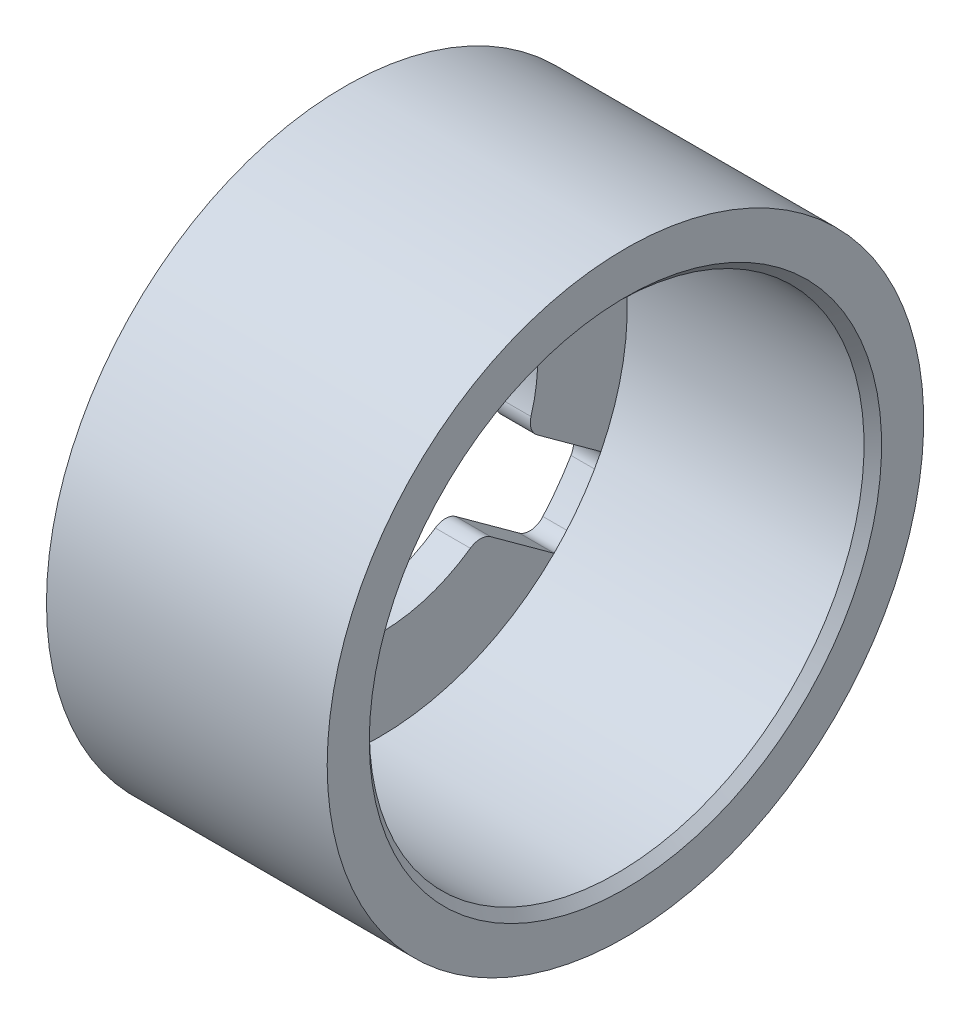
ISO-10303-21;
HEADER;
FILE_DESCRIPTION(('STEP AP214'),'2;1');
FILE_NAME('part.step','',(''),(''),'','','');
FILE_SCHEMA(('AUTOMOTIVE_DESIGN { 1 0 10303 214 1 1 1 1 }'));
ENDSEC;
DATA;
#1=APPLICATION_CONTEXT('core data for automotive mechanical design processes');
#2=APPLICATION_PROTOCOL_DEFINITION('international standard','automotive_design',2000,#1);
#3=PRODUCT_CONTEXT('',#1,'mechanical');
#4=PRODUCT('Part','Part','',(#3));
#5=PRODUCT_RELATED_PRODUCT_CATEGORY('part','',(#4));
#6=PRODUCT_DEFINITION_FORMATION('','',#4);
#7=PRODUCT_DEFINITION_CONTEXT('part definition',#1,'design');
#8=PRODUCT_DEFINITION('design','',#6,#7);
#9=PRODUCT_DEFINITION_SHAPE('','',#8);
#10=(LENGTH_UNIT() NAMED_UNIT(*) SI_UNIT(.MILLI.,.METRE.));
#11=(NAMED_UNIT(*) PLANE_ANGLE_UNIT() SI_UNIT($,.RADIAN.));
#12=(NAMED_UNIT(*) SI_UNIT($,.STERADIAN.) SOLID_ANGLE_UNIT());
#13=UNCERTAINTY_MEASURE_WITH_UNIT(LENGTH_MEASURE(1.E-05),#10,'distance_accuracy_value','');
#14=(GEOMETRIC_REPRESENTATION_CONTEXT(3) GLOBAL_UNCERTAINTY_ASSIGNED_CONTEXT((#13)) GLOBAL_UNIT_ASSIGNED_CONTEXT((#10,
#11,#12)) REPRESENTATION_CONTEXT('',''));
#15=CARTESIAN_POINT('',(0.,0.,0.));
#16=DIRECTION('',(0.,0.,1.));
#17=DIRECTION('',(1.,0.,0.));
#18=AXIS2_PLACEMENT_3D('',#15,#16,#17);
#19=CARTESIAN_POINT('',(-68.5530574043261,0.,0.));
#20=DIRECTION('',(-1.,0.,0.));
#21=DIRECTION('',(0.,0.,1.));
#22=AXIS2_PLACEMENT_3D('',#19,#20,#21);
#23=CYLINDRICAL_SURFACE('',#22,14.1);
#24=CARTESIAN_POINT('',(7.49999999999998,0.,0.));
#25=DIRECTION('',(-1.,0.,0.));
#26=DIRECTION('',(0.,0.,1.));
#27=AXIS2_PLACEMENT_3D('',#24,#25,#26);
#28=CIRCLE('',#27,14.1);
#29=CARTESIAN_POINT('',(7.49999999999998,0.,14.1));
#30=VERTEX_POINT('',#29);
#31=EDGE_CURVE('E462',#30,#30,#28,.F.);
#32=ORIENTED_EDGE('',*,*,#31,.T.);
#33=EDGE_LOOP('',(#32));
#34=FACE_BOUND('',#33,.T.);
#35=CARTESIAN_POINT('',(-5.99999999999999,0.,0.));
#36=DIRECTION('',(1.,0.,0.));
#37=DIRECTION('',(0.,0.,1.));
#38=AXIS2_PLACEMENT_3D('',#35,#36,#37);
#39=CIRCLE('',#38,14.1);
#40=CARTESIAN_POINT('',(-5.99999999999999,-12.5386078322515,6.44928783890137));
#41=VERTEX_POINT('',#40);
#42=CARTESIAN_POINT('',(-5.99999999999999,-13.9396577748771,2.12036344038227));
#43=VERTEX_POINT('',#42);
#44=EDGE_CURVE('E329',#41,#43,#39,.T.);
#45=ORIENTED_EDGE('',*,*,#44,.F.);
#46=CARTESIAN_POINT('',(-5.99999999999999,0.,0.));
#47=DIRECTION('',(-1.,0.,0.));
#48=DIRECTION('',(0.,0.,1.));
#49=AXIS2_PLACEMENT_3D('',#46,#47,#48);
#50=CIRCLE('',#49,14.1);
#51=CARTESIAN_POINT('',(-5.99999999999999,-2.29100568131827,13.9126306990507));
#52=VERTEX_POINT('',#51);
#53=EDGE_CURVE('E344',#52,#41,#50,.F.);
#54=ORIENTED_EDGE('',*,*,#53,.F.);
#55=CARTESIAN_POINT('',(-5.99999999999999,0.,0.));
#56=DIRECTION('',(1.,0.,0.));
#57=DIRECTION('',(0.,0.,1.));
#58=AXIS2_PLACEMENT_3D('',#55,#56,#57);
#59=CIRCLE('',#58,14.1);
#60=CARTESIAN_POINT('',(-5.99999999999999,2.25899431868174,13.9178642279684));
#61=VERTEX_POINT('',#60);
#62=EDGE_CURVE('E661',#61,#52,#59,.T.);
#63=ORIENTED_EDGE('',*,*,#62,.F.);
#64=CARTESIAN_POINT('',(-5.99999999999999,0.,0.));
#65=DIRECTION('',(-1.,0.,0.));
#66=DIRECTION('',(0.,0.,1.));
#67=AXIS2_PLACEMENT_3D('',#64,#65,#66);
#68=CIRCLE('',#67,14.1);
#69=CARTESIAN_POINT('',(-5.99999999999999,12.5237383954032,6.47811520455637));
#70=VERTEX_POINT('',#69);
#71=EDGE_CURVE('E449',#70,#61,#68,.F.);
#72=ORIENTED_EDGE('',*,*,#71,.F.);
#73=CARTESIAN_POINT('',(-5.99999999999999,0.,0.));
#74=DIRECTION('',(1.,0.,0.));
#75=DIRECTION('',(0.,0.,1.));
#76=AXIS2_PLACEMENT_3D('',#73,#74,#75);
#77=CIRCLE('',#76,14.1);
#78=CARTESIAN_POINT('',(-5.99999999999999,13.9347431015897,2.15242530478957));
#79=VERTEX_POINT('',#78);
#80=EDGE_CURVE('E730',#79,#70,#77,.T.);
#81=ORIENTED_EDGE('',*,*,#80,.F.);
#82=CARTESIAN_POINT('',(-5.99999999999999,0.,0.));
#83=DIRECTION('',(-1.,0.,0.));
#84=DIRECTION('',(0.,0.,1.));
#85=AXIS2_PLACEMENT_3D('',#82,#83,#84);
#86=CIRCLE('',#85,14.1);
#87=CARTESIAN_POINT('',(-5.99999999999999,10.0311016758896,-9.90893531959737));
#88=VERTEX_POINT('',#87);
#89=EDGE_CURVE('E428',#88,#79,#86,.F.);
#90=ORIENTED_EDGE('',*,*,#89,.F.);
#91=CARTESIAN_POINT('',(-5.99999999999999,0.,0.));
#92=DIRECTION('',(1.,0.,0.));
#93=DIRECTION('',(0.,0.,1.));
#94=AXIS2_PLACEMENT_3D('',#91,#92,#93);
#95=CIRCLE('',#94,14.1);
#96=CARTESIAN_POINT('',(-5.99999999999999,6.35315054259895,-12.5875922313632));
#97=VERTEX_POINT('',#96);
#98=EDGE_CURVE('E718',#97,#88,#95,.T.);
#99=ORIENTED_EDGE('',*,*,#98,.F.);
#100=CARTESIAN_POINT('',(-5.99999999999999,0.,0.));
#101=DIRECTION('',(-1.,0.,0.));
#102=DIRECTION('',(0.,0.,1.));
#103=AXIS2_PLACEMENT_3D('',#100,#101,#102);
#104=CIRCLE('',#103,14.1);
#105=CARTESIAN_POINT('',(-5.99999999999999,-6.32417661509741,-12.6021740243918));
#106=VERTEX_POINT('',#105);
#107=EDGE_CURVE('E407',#106,#97,#104,.F.);
#108=ORIENTED_EDGE('',*,*,#107,.F.);
#109=CARTESIAN_POINT('',(-5.99999999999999,0.,0.));
#110=DIRECTION('',(1.,0.,0.));
#111=DIRECTION('',(0.,0.,1.));
#112=AXIS2_PLACEMENT_3D('',#109,#110,#111);
#113=CIRCLE('',#112,14.1);
#114=CARTESIAN_POINT('',(-5.99999999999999,-10.0082801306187,-9.93198514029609));
#115=VERTEX_POINT('',#114);
#116=EDGE_CURVE('E698',#115,#106,#113,.T.);
#117=ORIENTED_EDGE('',*,*,#116,.F.);
#118=CARTESIAN_POINT('',(-5.99999999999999,0.,0.));
#119=DIRECTION('',(-1.,0.,0.));
#120=DIRECTION('',(0.,0.,1.));
#121=AXIS2_PLACEMENT_3D('',#118,#119,#120);
#122=CIRCLE('',#121,14.1);
#123=EDGE_CURVE('E347',#43,#115,#122,.F.);
#124=ORIENTED_EDGE('',*,*,#123,.F.);
#125=EDGE_LOOP('',(#45,#54,#63,#72,#81,#90,#99,#108,#117,#124));
#126=FACE_BOUND('',#125,.T.);
#127=ADVANCED_FACE('F38',(#34,#126),#23,.F.);
#128=CARTESIAN_POINT('',(8.,0.,-14.1));
#129=DIRECTION('',(-1.,0.,0.));
#130=DIRECTION('',(0.,0.,1.));
#131=AXIS2_PLACEMENT_3D('',#128,#129,#130);
#132=PLANE('',#131);
#133=CARTESIAN_POINT('',(8.,0.,0.));
#134=DIRECTION('',(-1.,0.,0.));
#135=DIRECTION('',(0.,0.,1.));
#136=AXIS2_PLACEMENT_3D('',#133,#134,#135);
#137=CIRCLE('',#136,14.6);
#138=CARTESIAN_POINT('',(8.,0.,14.6));
#139=VERTEX_POINT('',#138);
#140=EDGE_CURVE('E452',#139,#139,#137,.T.);
#141=ORIENTED_EDGE('',*,*,#140,.T.);
#142=EDGE_LOOP('',(#141));
#143=FACE_BOUND('',#142,.T.);
#144=CARTESIAN_POINT('',(7.99999999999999,0.,0.));
#145=DIRECTION('',(-1.,0.,0.));
#146=DIRECTION('',(0.,0.,1.));
#147=AXIS2_PLACEMENT_3D('',#144,#145,#146);
#148=CIRCLE('',#147,17.);
#149=CARTESIAN_POINT('',(7.99999999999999,0.,17.));
#150=VERTEX_POINT('',#149);
#151=EDGE_CURVE('E375',#150,#150,#148,.F.);
#152=ORIENTED_EDGE('',*,*,#151,.T.);
#153=EDGE_LOOP('',(#152));
#154=FACE_BOUND('',#153,.T.);
#155=ADVANCED_FACE('F789',(#143,#154),#132,.F.);
#156=CARTESIAN_POINT('',(-7.99999999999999,0.,-15.9));
#157=DIRECTION('',(1.,0.,0.));
#158=DIRECTION('',(0.,0.,-1.));
#159=AXIS2_PLACEMENT_3D('',#156,#157,#158);
#160=PLANE('',#159);
#161=CARTESIAN_POINT('',(-7.99999999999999,0.,0.));
#162=DIRECTION('',(-1.,0.,0.));
#163=DIRECTION('',(0.,0.,1.));
#164=AXIS2_PLACEMENT_3D('',#161,#162,#163);
#165=CIRCLE('',#164,15.);
#166=CARTESIAN_POINT('',(-7.99999999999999,-14.6325016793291,3.299984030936));
#167=VERTEX_POINT('',#166);
#168=CARTESIAN_POINT('',(-7.99999999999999,-13.7912061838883,5.8993755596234));
#169=VERTEX_POINT('',#168);
#170=EDGE_CURVE('E689',#167,#169,#165,.T.);
#171=ORIENTED_EDGE('',*,*,#170,.F.);
#172=CARTESIAN_POINT('',(-7.99999999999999,-13.6570015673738,3.07998509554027));
#173=DIRECTION('',(1.,0.,0.));
#174=DIRECTION('',(0.,0.,-1.));
#175=AXIS2_PLACEMENT_3D('',#172,#173,#174);
#176=CIRCLE('',#175,1.);
#177=CARTESIAN_POINT('',(-7.99999999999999,-13.9660185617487,2.12892857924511));
#178=VERTEX_POINT('',#177);
#179=EDGE_CURVE('E622',#167,#178,#176,.T.);
#180=ORIENTED_EDGE('',*,*,#179,.T.);
#181=DIRECTION('',(0.,-0.951056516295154,0.309016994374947));
#182=VECTOR('',#181,1.);
#183=CARTESIAN_POINT('',(-7.99999999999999,-0.707959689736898,-2.17887588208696));
#184=LINE('',#183,#182);
#185=CARTESIAN_POINT('',(-7.99999999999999,-9.68873765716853,0.739155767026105));
#186=VERTEX_POINT('',#185);
#187=EDGE_CURVE('E364',#186,#178,#184,.T.);
#188=ORIENTED_EDGE('',*,*,#187,.F.);
#189=CARTESIAN_POINT('',(-7.99999999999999,-9.99775465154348,-0.211900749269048));
#190=DIRECTION('',(1.,0.,0.));
#191=DIRECTION('',(0.,0.,-1.));
#192=AXIS2_PLACEMENT_3D('',#189,#190,#191);
#193=CIRCLE('',#192,1.);
#194=CARTESIAN_POINT('',(-7.99999999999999,-8.99797918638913,-0.190710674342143));
#195=VERTEX_POINT('',#194);
#196=EDGE_CURVE('E486',#186,#195,#193,.F.);
#197=ORIENTED_EDGE('',*,*,#196,.T.);
#198=CARTESIAN_POINT('',(-7.99999999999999,0.,0.));
#199=DIRECTION('',(-1.,0.,0.));
#200=DIRECTION('',(0.,0.,1.));
#201=AXIS2_PLACEMENT_3D('',#198,#199,#200);
#202=CIRCLE('',#201,9.);
#203=CARTESIAN_POINT('',(-7.99999999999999,-7.37417670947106,-5.15960442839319));
#204=VERTEX_POINT('',#203);
#205=EDGE_CURVE('E367',#195,#204,#202,.F.);
#206=ORIENTED_EDGE('',*,*,#205,.T.);
#207=CARTESIAN_POINT('',(-7.99999999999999,-8.19352967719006,-5.73289380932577));
#208=DIRECTION('',(1.,0.,0.));
#209=DIRECTION('',(0.,0.,-1.));
#210=AXIS2_PLACEMENT_3D('',#207,#208,#209);
#211=CIRCLE('',#210,1.);
#212=CARTESIAN_POINT('',(-7.99999999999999,-7.38451268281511,-6.32067906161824));
#213=VERTEX_POINT('',#212);
#214=EDGE_CURVE('E484',#204,#213,#211,.F.);
#215=ORIENTED_EDGE('',*,*,#214,.T.);
#216=DIRECTION('',(0.,-0.587785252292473,-0.809016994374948));
#217=VECTOR('',#216,1.);
#218=CARTESIAN_POINT('',(-7.99999999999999,-1.82756479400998,1.32780354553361));
#219=LINE('',#218,#217);
#220=CARTESIAN_POINT('',(-7.99999999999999,-10.0232165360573,-9.95254333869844));
#221=VERTEX_POINT('',#220);
#222=EDGE_CURVE('E385',#213,#221,#219,.T.);
#223=ORIENTED_EDGE('',*,*,#222,.T.);
#224=CARTESIAN_POINT('',(-7.99999999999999,-9.21419954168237,-10.5403285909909));
#225=DIRECTION('',(1.,0.,0.));
#226=DIRECTION('',(0.,0.,-1.));
#227=AXIS2_PLACEMENT_3D('',#224,#225,#226);
#228=CIRCLE('',#227,1.);
#229=CARTESIAN_POINT('',(-7.99999999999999,-9.87235665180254,-11.2932092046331));
#230=VERTEX_POINT('',#229);
#231=EDGE_CURVE('E624',#221,#230,#228,.T.);
#232=ORIENTED_EDGE('',*,*,#231,.T.);
#233=CARTESIAN_POINT('',(-7.99999999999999,0.,0.));
#234=DIRECTION('',(-1.,0.,0.));
#235=DIRECTION('',(0.,0.,1.));
#236=AXIS2_PLACEMENT_3D('',#233,#234,#235);
#237=CIRCLE('',#236,15.);
#238=CARTESIAN_POINT('',(-7.99999999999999,-7.66016300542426,-12.8965849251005));
#239=VERTEX_POINT('',#238);
#240=EDGE_CURVE('E706',#239,#230,#237,.T.);
#241=ORIENTED_EDGE('',*,*,#240,.F.);
#242=CARTESIAN_POINT('',(-7.99999999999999,-7.14948547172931,-12.0368125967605));
#243=DIRECTION('',(1.,0.,0.));
#244=DIRECTION('',(0.,0.,-1.));
#245=AXIS2_PLACEMENT_3D('',#242,#243,#244);
#246=CIRCLE('',#245,1.);
#247=CARTESIAN_POINT('',(-7.99999999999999,-6.34046847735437,-12.6245978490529));
#248=VERTEX_POINT('',#247);
#249=EDGE_CURVE('E626',#239,#248,#246,.T.);
#250=ORIENTED_EDGE('',*,*,#249,.T.);
#251=DIRECTION('',(0.,-0.587785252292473,-0.809016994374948));
#252=VECTOR('',#251,1.);
#253=CARTESIAN_POINT('',(-7.99999999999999,1.85346253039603,-1.34661935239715));
#254=LINE('',#253,#252);
#255=CARTESIAN_POINT('',(-7.99999999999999,-3.69696349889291,-8.98612539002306));
#256=VERTEX_POINT('',#255);
#257=EDGE_CURVE('E391',#256,#248,#254,.T.);
#258=ORIENTED_EDGE('',*,*,#257,.F.);
#259=CARTESIAN_POINT('',(-7.99999999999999,-2.88794650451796,-9.57391064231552));
#260=DIRECTION('',(1.,0.,0.));
#261=DIRECTION('',(0.,0.,-1.));
#262=AXIS2_PLACEMENT_3D('',#259,#260,#261);
#263=CIRCLE('',#262,1.);
#264=CARTESIAN_POINT('',(-7.99999999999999,-2.59915185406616,-8.61651957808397));
#265=VERTEX_POINT('',#264);
#266=EDGE_CURVE('E480',#256,#265,#263,.F.);
#267=ORIENTED_EDGE('',*,*,#266,.T.);
#268=CARTESIAN_POINT('',(-7.99999999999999,0.,0.));
#269=DIRECTION('',(-1.,0.,0.));
#270=DIRECTION('',(0.,0.,1.));
#271=AXIS2_PLACEMENT_3D('',#268,#269,#270);
#272=CIRCLE('',#271,9.);
#273=CARTESIAN_POINT('',(-7.99999999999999,2.62832949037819,-8.60766426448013));
#274=VERTEX_POINT('',#273);
#275=EDGE_CURVE('E413',#265,#274,#272,.F.);
#276=ORIENTED_EDGE('',*,*,#275,.T.);
#277=CARTESIAN_POINT('',(-7.99999999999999,2.92036610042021,-9.56407140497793));
#278=DIRECTION('',(1.,0.,0.));
#279=DIRECTION('',(0.,0.,-1.));
#280=AXIS2_PLACEMENT_3D('',#277,#278,#279);
#281=CIRCLE('',#280,1.);
#282=CARTESIAN_POINT('',(-7.99999999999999,3.72938309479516,-8.97628615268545));
#283=VERTEX_POINT('',#282);
#284=EDGE_CURVE('E482',#274,#283,#281,.F.);
#285=ORIENTED_EDGE('',*,*,#284,.T.);
#286=DIRECTION('',(0.,0.587785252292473,-0.809016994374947));
#287=VECTOR('',#286,1.);
#288=CARTESIAN_POINT('',(-7.99999999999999,-1.82756479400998,-1.3278035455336));
#289=LINE('',#288,#287);
#290=CARTESIAN_POINT('',(-7.99999999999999,6.36808694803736,-12.6081504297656));
#291=VERTEX_POINT('',#290);
#292=EDGE_CURVE('E401',#283,#291,#289,.T.);
#293=ORIENTED_EDGE('',*,*,#292,.T.);
#294=CARTESIAN_POINT('',(-7.99999999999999,7.17710394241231,-12.0203651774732));
#295=DIRECTION('',(1.,0.,0.));
#296=DIRECTION('',(0.,0.,-1.));
#297=AXIS2_PLACEMENT_3D('',#294,#295,#296);
#298=CIRCLE('',#297,1.);
#299=CARTESIAN_POINT('',(-7.99999999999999,7.68975422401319,-12.8789626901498));
#300=VERTEX_POINT('',#299);
#301=EDGE_CURVE('E628',#291,#300,#298,.T.);
#302=ORIENTED_EDGE('',*,*,#301,.T.);
#303=CARTESIAN_POINT('',(-7.99999999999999,0.,0.));
#304=DIRECTION('',(-1.,0.,0.));
#305=DIRECTION('',(0.,0.,1.));
#306=AXIS2_PLACEMENT_3D('',#303,#304,#305);
#307=CIRCLE('',#306,15.);
#308=CARTESIAN_POINT('',(-7.99999999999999,9.89826058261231,-11.2705118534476));
#309=VERTEX_POINT('',#308);
#310=EDGE_CURVE('E716',#309,#300,#307,.T.);
#311=ORIENTED_EDGE('',*,*,#310,.F.);
#312=CARTESIAN_POINT('',(-7.99999999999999,9.23837654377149,-10.5191443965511));
#313=DIRECTION('',(1.,0.,0.));
#314=DIRECTION('',(0.,0.,-1.));
#315=AXIS2_PLACEMENT_3D('',#312,#313,#314);
#316=CIRCLE('',#315,1.);
#317=CARTESIAN_POINT('',(-7.99999999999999,10.0473935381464,-9.93135914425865));
#318=VERTEX_POINT('',#317);
#319=EDGE_CURVE('E630',#309,#318,#316,.T.);
#320=ORIENTED_EDGE('',*,*,#319,.T.);
#321=DIRECTION('',(0.,0.587785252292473,-0.809016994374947));
#322=VECTOR('',#321,1.);
#323=CARTESIAN_POINT('',(-7.99999999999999,1.85346253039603,1.34661935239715));
#324=LINE('',#323,#322);
#325=CARTESIAN_POINT('',(-7.99999999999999,7.40388855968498,-6.29288668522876));
#326=VERTEX_POINT('',#325);
#327=EDGE_CURVE('E410',#326,#318,#324,.T.);
#328=ORIENTED_EDGE('',*,*,#327,.F.);
#329=CARTESIAN_POINT('',(-7.99999999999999,8.21290555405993,-5.70510143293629));
#330=DIRECTION('',(1.,0.,0.));
#331=DIRECTION('',(0.,0.,-1.));
#332=AXIS2_PLACEMENT_3D('',#329,#330,#331);
#333=CIRCLE('',#332,1.);
#334=CARTESIAN_POINT('',(-7.99999999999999,7.39161499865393,-5.13459128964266));
#335=VERTEX_POINT('',#334);
#336=EDGE_CURVE('E478',#326,#335,#333,.F.);
#337=ORIENTED_EDGE('',*,*,#336,.T.);
#338=CARTESIAN_POINT('',(-7.99999999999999,0.,0.));
#339=DIRECTION('',(-1.,0.,0.));
#340=DIRECTION('',(0.,0.,1.));
#341=AXIS2_PLACEMENT_3D('',#338,#339,#340);
#342=CIRCLE('',#341,9.);
#343=CARTESIAN_POINT('',(-7.99999999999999,8.99857366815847,-0.160224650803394));
#344=VERTEX_POINT('',#343);
#345=EDGE_CURVE('E434',#335,#344,#342,.F.);
#346=ORIENTED_EDGE('',*,*,#345,.T.);
#347=CARTESIAN_POINT('',(-7.99999999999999,9.99841518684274,-0.178027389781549));
#348=DIRECTION('',(1.,0.,0.));
#349=DIRECTION('',(0.,0.,-1.));
#350=AXIS2_PLACEMENT_3D('',#347,#348,#349);
#351=CIRCLE('',#350,1.);
#352=CARTESIAN_POINT('',(-7.99999999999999,9.6893981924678,0.773029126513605));
#353=VERTEX_POINT('',#352);
#354=EDGE_CURVE('E476',#344,#353,#351,.F.);
#355=ORIENTED_EDGE('',*,*,#354,.T.);
#356=DIRECTION('',(0.,0.951056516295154,0.309016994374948));
#357=VECTOR('',#356,1.);
#358=CARTESIAN_POINT('',(-7.99999999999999,0.698067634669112,-2.14843126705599));
#359=LINE('',#358,#357);
#360=CARTESIAN_POINT('',(-7.99999999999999,13.958910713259,2.16027783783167));
#361=VERTEX_POINT('',#360);
#362=EDGE_CURVE('E422',#353,#361,#359,.T.);
#363=ORIENTED_EDGE('',*,*,#362,.T.);
#364=CARTESIAN_POINT('',(-7.99999999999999,13.649893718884,3.11133435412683));
#365=DIRECTION('',(1.,0.,0.));
#366=DIRECTION('',(0.,0.,-1.));
#367=AXIS2_PLACEMENT_3D('',#364,#365,#366);
#368=CIRCLE('',#367,1.);
#369=CARTESIAN_POINT('',(-7.99999999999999,14.6248861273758,3.33357252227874));
#370=VERTEX_POINT('',#369);
#371=EDGE_CURVE('E634',#361,#370,#368,.T.);
#372=ORIENTED_EDGE('',*,*,#371,.T.);
#373=CARTESIAN_POINT('',(-7.99999999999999,0.,0.));
#374=DIRECTION('',(-1.,0.,0.));
#375=DIRECTION('',(0.,0.,1.));
#376=AXIS2_PLACEMENT_3D('',#373,#374,#375);
#377=CIRCLE('',#376,15.);
#378=CARTESIAN_POINT('',(-7.99999999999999,13.777624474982,5.93102552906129));
#379=VERTEX_POINT('',#378);
#380=EDGE_CURVE('E665',#379,#370,#377,.T.);
#381=ORIENTED_EDGE('',*,*,#380,.F.);
#382=CARTESIAN_POINT('',(-7.99999999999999,12.8591161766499,5.53562382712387));
#383=DIRECTION('',(1.,0.,0.));
#384=DIRECTION('',(0.,0.,-1.));
#385=AXIS2_PLACEMENT_3D('',#382,#383,#384);
#386=CIRCLE('',#385,1.);
#387=CARTESIAN_POINT('',(-7.99999999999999,12.5500991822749,6.48668034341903));
#388=VERTEX_POINT('',#387);
#389=EDGE_CURVE('E632',#379,#388,#386,.T.);
#390=ORIENTED_EDGE('',*,*,#389,.T.);
#391=DIRECTION('',(0.,0.951056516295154,0.309016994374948));
#392=VECTOR('',#391,1.);
#393=CARTESIAN_POINT('',(-7.99999999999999,-0.707959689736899,2.17887588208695));
#394=LINE('',#393,#392);
#395=CARTESIAN_POINT('',(-7.99999999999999,8.27281827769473,5.09690753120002));
#396=VERTEX_POINT('',#395);
#397=EDGE_CURVE('E431',#396,#388,#394,.T.);
#398=ORIENTED_EDGE('',*,*,#397,.F.);
#399=CARTESIAN_POINT('',(-7.99999999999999,7.96380128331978,6.04796404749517));
#400=DIRECTION('',(1.,0.,0.));
#401=DIRECTION('',(0.,0.,-1.));
#402=AXIS2_PLACEMENT_3D('',#399,#400,#401);
#403=CIRCLE('',#402,1.);
#404=CARTESIAN_POINT('',(-7.99999999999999,7.1674211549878,5.44316764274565));
#405=VERTEX_POINT('',#404);
#406=EDGE_CURVE('E468',#396,#405,#403,.F.);
#407=ORIENTED_EDGE('',*,*,#406,.T.);
#408=CARTESIAN_POINT('',(-7.99999999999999,0.,0.));
#409=DIRECTION('',(-1.,0.,0.));
#410=DIRECTION('',(0.,0.,1.));
#411=AXIS2_PLACEMENT_3D('',#408,#409,#410);
#412=CIRCLE('',#411,9.);
#413=CARTESIAN_POINT('',(-7.99999999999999,2.93309488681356,8.50863998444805));
#414=VERTEX_POINT('',#413);
#415=EDGE_CURVE('E455',#405,#414,#412,.F.);
#416=ORIENTED_EDGE('',*,*,#415,.T.);
#417=CARTESIAN_POINT('',(-7.99999999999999,3.25899431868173,9.4540444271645));
#418=DIRECTION('',(1.,0.,0.));
#419=DIRECTION('',(0.,0.,-1.));
#420=AXIS2_PLACEMENT_3D('',#417,#418,#419);
#421=CIRCLE('',#420,1.);
#422=CARTESIAN_POINT('',(-7.99999999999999,2.25899431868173,9.4540444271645));
#423=VERTEX_POINT('',#422);
#424=EDGE_CURVE('E470',#414,#423,#421,.F.);
#425=ORIENTED_EDGE('',*,*,#424,.T.);
#426=DIRECTION('',(0.,0.,1.));
#427=VECTOR('',#426,1.);
#428=CARTESIAN_POINT('',(-7.99999999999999,2.25899431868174,0.));
#429=LINE('',#428,#427);
#430=CARTESIAN_POINT('',(-7.99999999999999,2.25899431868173,13.9432755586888));
#431=VERTEX_POINT('',#430);
#432=EDGE_CURVE('E443',#423,#431,#429,.T.);
#433=ORIENTED_EDGE('',*,*,#432,.T.);
#434=CARTESIAN_POINT('',(-7.99999999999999,1.25899431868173,13.9432755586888));
#435=DIRECTION('',(1.,0.,0.));
#436=DIRECTION('',(0.,0.,-1.));
#437=AXIS2_PLACEMENT_3D('',#434,#435,#436);
#438=CIRCLE('',#437,1.);
#439=CARTESIAN_POINT('',(-7.99999999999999,1.34892248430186,14.9392238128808));
#440=VERTEX_POINT('',#439);
#441=EDGE_CURVE('E11',#431,#440,#438,.T.);
#442=ORIENTED_EDGE('',*,*,#441,.T.);
#443=CARTESIAN_POINT('',(-7.99999999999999,0.,0.));
#444=DIRECTION('',(-1.,0.,0.));
#445=DIRECTION('',(0.,0.,1.));
#446=AXIS2_PLACEMENT_3D('',#443,#444,#445);
#447=CIRCLE('',#446,15.);
#448=CARTESIAN_POINT('',(-7.99999999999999,-1.383220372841,14.9360872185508));
#449=VERTEX_POINT('',#448);
#450=EDGE_CURVE('E642',#449,#440,#447,.T.);
#451=ORIENTED_EDGE('',*,*,#450,.F.);
#452=CARTESIAN_POINT('',(-7.99999999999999,-1.29100568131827,13.9403480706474));
#453=DIRECTION('',(1.,0.,0.));
#454=DIRECTION('',(0.,0.,-1.));
#455=AXIS2_PLACEMENT_3D('',#452,#453,#454);
#456=CIRCLE('',#455,1.);
#457=CARTESIAN_POINT('',(-7.99999999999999,-2.29100568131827,13.9403480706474));
#458=VERTEX_POINT('',#457);
#459=EDGE_CURVE('E46',#449,#458,#456,.T.);
#460=ORIENTED_EDGE('',*,*,#459,.T.);
#461=DIRECTION('',(0.,0.,1.));
#462=VECTOR('',#461,1.);
#463=CARTESIAN_POINT('',(-7.99999999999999,-2.29100568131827,0.));
#464=LINE('',#463,#462);
#465=CARTESIAN_POINT('',(-7.99999999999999,-2.29100568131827,9.44294877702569));
#466=VERTEX_POINT('',#465);
#467=EDGE_CURVE('E371',#466,#458,#464,.T.);
#468=ORIENTED_EDGE('',*,*,#467,.F.);
#469=CARTESIAN_POINT('',(-7.99999999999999,-3.29100568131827,9.44294877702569));
#470=DIRECTION('',(1.,0.,0.));
#471=DIRECTION('',(0.,0.,-1.));
#472=AXIS2_PLACEMENT_3D('',#469,#470,#471);
#473=CIRCLE('',#472,1.);
#474=CARTESIAN_POINT('',(-7.99999999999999,-2.96190511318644,8.49865389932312));
#475=VERTEX_POINT('',#474);
#476=EDGE_CURVE('E472',#466,#475,#473,.F.);
#477=ORIENTED_EDGE('',*,*,#476,.T.);
#478=CARTESIAN_POINT('',(-7.99999999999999,0.,0.));
#479=DIRECTION('',(-1.,0.,0.));
#480=DIRECTION('',(0.,0.,1.));
#481=AXIS2_PLACEMENT_3D('',#478,#479,#480);
#482=CIRCLE('',#481,9.);
#483=CARTESIAN_POINT('',(-7.99999999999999,-7.18582133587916,5.41885335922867));
#484=VERTEX_POINT('',#483);
#485=EDGE_CURVE('E374',#475,#484,#482,.F.);
#486=ORIENTED_EDGE('',*,*,#485,.T.);
#487=CARTESIAN_POINT('',(-7.99999999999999,-7.98424592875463,6.02094817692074));
#488=DIRECTION('',(1.,0.,0.));
#489=DIRECTION('',(0.,0.,-1.));
#490=AXIS2_PLACEMENT_3D('',#487,#488,#489);
#491=CIRCLE('',#490,1.);
#492=CARTESIAN_POINT('',(-7.99999999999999,-8.29326292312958,5.06989166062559));
#493=VERTEX_POINT('',#492);
#494=EDGE_CURVE('E474',#484,#493,#491,.F.);
#495=ORIENTED_EDGE('',*,*,#494,.T.);
#496=DIRECTION('',(0.,-0.951056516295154,0.309016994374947));
#497=VECTOR('',#496,1.);
#498=CARTESIAN_POINT('',(-7.99999999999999,0.698067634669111,2.148431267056));
#499=LINE('',#498,#497);
#500=CARTESIAN_POINT('',(-7.99999999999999,-12.5627754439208,6.45714037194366));
#501=VERTEX_POINT('',#500);
#502=EDGE_CURVE('E378',#493,#501,#499,.T.);
#503=ORIENTED_EDGE('',*,*,#502,.T.);
#504=CARTESIAN_POINT('',(-7.99999999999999,-12.8717924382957,5.5060838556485));
#505=DIRECTION('',(1.,0.,0.));
#506=DIRECTION('',(0.,0.,-1.));
#507=AXIS2_PLACEMENT_3D('',#504,#505,#506);
#508=CIRCLE('',#507,1.);
#509=EDGE_CURVE('E620',#501,#169,#508,.T.);
#510=ORIENTED_EDGE('',*,*,#509,.T.);
#511=EDGE_LOOP('',(#171,#180,#188,#197,#206,#215,#223,#232,#241,#250,#258,#267,#276,#285,#293,
#302,#311,#320,#328,#337,#346,#355,#363,#372,#381,#390,#398,#407,#416,#425,#433,#442,#451,#460,
#468,#477,#486,#495,#503,#510));
#512=FACE_BOUND('',#511,.T.);
#513=CARTESIAN_POINT('',(-7.99999999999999,0.,0.));
#514=DIRECTION('',(-1.,0.,0.));
#515=DIRECTION('',(0.,0.,1.));
#516=AXIS2_PLACEMENT_3D('',#513,#514,#515);
#517=CIRCLE('',#516,17.);
#518=CARTESIAN_POINT('',(-7.99999999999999,0.,17.));
#519=VERTEX_POINT('',#518);
#520=EDGE_CURVE('E669',#519,#519,#517,.T.);
#521=ORIENTED_EDGE('',*,*,#520,.T.);
#522=EDGE_LOOP('',(#521));
#523=FACE_BOUND('',#522,.T.);
#524=ADVANCED_FACE('F639',(#512,#523),#160,.F.);
#525=CARTESIAN_POINT('',(7.99999999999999,0.,0.));
#526=DIRECTION('',(1.,0.,0.));
#527=DIRECTION('',(0.,0.,-1.));
#528=AXIS2_PLACEMENT_3D('',#525,#526,#527);
#529=CONICAL_SURFACE('',#528,14.6,0.785398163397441);
#530=ORIENTED_EDGE('',*,*,#31,.F.);
#531=EDGE_LOOP('',(#530));
#532=FACE_BOUND('',#531,.T.);
#533=ORIENTED_EDGE('',*,*,#140,.F.);
#534=EDGE_LOOP('',(#533));
#535=FACE_BOUND('',#534,.T.);
#536=ADVANCED_FACE('F801',(#532,#535),#529,.F.);
#537=CARTESIAN_POINT('',(-5.99999999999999,-0.707959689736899,2.17887588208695));
#538=DIRECTION('',(0.,-0.309016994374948,0.951056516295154));
#539=DIRECTION('',(0.,-0.951056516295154,-0.309016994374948));
#540=AXIS2_PLACEMENT_3D('',#537,#538,#539);
#541=PLANE('',#540);
#542=ORIENTED_EDGE('',*,*,#397,.T.);
#543=DIRECTION('',(1.,0.,0.));
#544=VECTOR('',#543,1.);
#545=CARTESIAN_POINT('',(-5.99999999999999,12.5500991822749,6.48668034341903));
#546=LINE('',#545,#544);
#547=CARTESIAN_POINT('',(-5.99999999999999,12.5500991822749,6.48668034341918));
#548=VERTEX_POINT('',#547);
#549=EDGE_CURVE('E599',#388,#548,#546,.T.);
#550=ORIENTED_EDGE('',*,*,#549,.T.);
#551=DIRECTION('',(0.,0.95105651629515,0.309016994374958));
#552=VECTOR('',#551,1.);
#553=CARTESIAN_POINT('',(-5.99999999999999,12.5237383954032,6.47811520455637));
#554=LINE('',#553,#552);
#555=EDGE_CURVE('E724',#70,#548,#554,.T.);
#556=ORIENTED_EDGE('',*,*,#555,.F.);
#557=DIRECTION('',(0.,0.951056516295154,0.309016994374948));
#558=VECTOR('',#557,1.);
#559=CARTESIAN_POINT('',(-5.99999999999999,-0.707959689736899,2.17887588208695));
#560=LINE('',#559,#558);
#561=CARTESIAN_POINT('',(-5.99999999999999,8.27281827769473,5.09690753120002));
#562=VERTEX_POINT('',#561);
#563=EDGE_CURVE('E439',#562,#70,#560,.T.);
#564=ORIENTED_EDGE('',*,*,#563,.F.);
#565=DIRECTION('',(1.,0.,0.));
#566=VECTOR('',#565,1.);
#567=CARTESIAN_POINT('',(-7.99999999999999,8.27281827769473,5.09690753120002));
#568=LINE('',#567,#566);
#569=EDGE_CURVE('E551',#562,#396,#568,.F.);
#570=ORIENTED_EDGE('',*,*,#569,.T.);
#571=EDGE_LOOP('',(#542,#550,#556,#564,#570));
#572=FACE_BOUND('',#571,.T.);
#573=ADVANCED_FACE('F770',(#572),#541,.F.);
#574=CARTESIAN_POINT('',(-5.99999999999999,2.25899431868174,0.));
#575=DIRECTION('',(0.,-1.,0.));
#576=DIRECTION('',(0.,0.,-1.));
#577=AXIS2_PLACEMENT_3D('',#574,#575,#576);
#578=PLANE('',#577);
#579=DIRECTION('',(0.,0.,-1.));
#580=VECTOR('',#579,1.);
#581=CARTESIAN_POINT('',(-5.99999999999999,2.25899431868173,13.9178642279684));
#582=LINE('',#581,#580);
#583=CARTESIAN_POINT('',(-5.99999999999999,2.25899431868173,13.9432755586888));
#584=VERTEX_POINT('',#583);
#585=EDGE_CURVE('E659',#584,#61,#582,.T.);
#586=ORIENTED_EDGE('',*,*,#585,.F.);
#587=DIRECTION('',(-1.,0.,0.));
#588=VECTOR('',#587,1.);
#589=CARTESIAN_POINT('',(-5.99999999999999,2.25899431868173,13.9432755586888));
#590=LINE('',#589,#588);
#591=EDGE_CURVE('E618',#584,#431,#590,.T.);
#592=ORIENTED_EDGE('',*,*,#591,.T.);
#593=ORIENTED_EDGE('',*,*,#432,.F.);
#594=DIRECTION('',(-1.,0.,0.));
#595=VECTOR('',#594,1.);
#596=CARTESIAN_POINT('',(-5.99999999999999,2.25899431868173,9.4540444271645));
#597=LINE('',#596,#595);
#598=CARTESIAN_POINT('',(-5.99999999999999,2.25899431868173,9.4540444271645));
#599=VERTEX_POINT('',#598);
#600=EDGE_CURVE('E545',#423,#599,#597,.F.);
#601=ORIENTED_EDGE('',*,*,#600,.T.);
#602=DIRECTION('',(0.,0.,1.));
#603=VECTOR('',#602,1.);
#604=CARTESIAN_POINT('',(-5.99999999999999,2.25899431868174,0.));
#605=LINE('',#604,#603);
#606=EDGE_CURVE('E446',#599,#61,#605,.T.);
#607=ORIENTED_EDGE('',*,*,#606,.T.);
#608=EDGE_LOOP('',(#586,#592,#593,#601,#607));
#609=FACE_BOUND('',#608,.T.);
#610=ADVANCED_FACE('F783',(#609),#578,.T.);
#611=CARTESIAN_POINT('',(-5.99999999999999,0.,0.));
#612=DIRECTION('',(-1.,0.,0.));
#613=DIRECTION('',(0.,0.,1.));
#614=AXIS2_PLACEMENT_3D('',#611,#612,#613);
#615=CYLINDRICAL_SURFACE('',#614,9.);
#616=CARTESIAN_POINT('',(-5.99999999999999,0.,0.));
#617=DIRECTION('',(-1.,0.,0.));
#618=DIRECTION('',(0.,0.,1.));
#619=AXIS2_PLACEMENT_3D('',#616,#617,#618);
#620=CIRCLE('',#619,9.);
#621=CARTESIAN_POINT('',(-5.99999999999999,7.1674211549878,5.44316764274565));
#622=VERTEX_POINT('',#621);
#623=CARTESIAN_POINT('',(-5.99999999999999,2.93309488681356,8.50863998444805));
#624=VERTEX_POINT('',#623);
#625=EDGE_CURVE('E442',#622,#624,#620,.F.);
#626=ORIENTED_EDGE('',*,*,#625,.T.);
#627=DIRECTION('',(-1.,0.,0.));
#628=VECTOR('',#627,1.);
#629=CARTESIAN_POINT('',(-5.99999999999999,2.93309488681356,8.50863998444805));
#630=LINE('',#629,#628);
#631=EDGE_CURVE('E542',#624,#414,#630,.T.);
#632=ORIENTED_EDGE('',*,*,#631,.T.);
#633=ORIENTED_EDGE('',*,*,#415,.F.);
#634=DIRECTION('',(-1.,0.,0.));
#635=VECTOR('',#634,1.);
#636=CARTESIAN_POINT('',(-5.99999999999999,7.1674211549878,5.44316764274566));
#637=LINE('',#636,#635);
#638=EDGE_CURVE('E540',#405,#622,#637,.F.);
#639=ORIENTED_EDGE('',*,*,#638,.T.);
#640=EDGE_LOOP('',(#626,#632,#633,#639));
#641=FACE_BOUND('',#640,.T.);
#642=ADVANCED_FACE('F776',(#641),#615,.F.);
#643=CARTESIAN_POINT('',(-5.99999999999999,0.,0.));
#644=DIRECTION('',(-1.,0.,0.));
#645=DIRECTION('',(0.,0.,1.));
#646=AXIS2_PLACEMENT_3D('',#643,#644,#645);
#647=PLANE('',#646);
#648=ORIENTED_EDGE('',*,*,#606,.F.);
#649=CARTESIAN_POINT('',(-5.99999999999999,3.25899431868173,9.4540444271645));
#650=DIRECTION('',(-1.,0.,0.));
#651=DIRECTION('',(0.,0.,1.));
#652=AXIS2_PLACEMENT_3D('',#649,#650,#651);
#653=CIRCLE('',#652,1.);
#654=EDGE_CURVE('E549',#599,#624,#653,.F.);
#655=ORIENTED_EDGE('',*,*,#654,.T.);
#656=ORIENTED_EDGE('',*,*,#625,.F.);
#657=CARTESIAN_POINT('',(-5.99999999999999,7.96380128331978,6.04796404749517));
#658=DIRECTION('',(-1.,0.,0.));
#659=DIRECTION('',(0.,0.,1.));
#660=AXIS2_PLACEMENT_3D('',#657,#658,#659);
#661=CIRCLE('',#660,1.);
#662=EDGE_CURVE('E547',#622,#562,#661,.F.);
#663=ORIENTED_EDGE('',*,*,#662,.T.);
#664=ORIENTED_EDGE('',*,*,#563,.T.);
#665=ORIENTED_EDGE('',*,*,#71,.T.);
#666=EDGE_LOOP('',(#648,#655,#656,#663,#664,#665));
#667=FACE_BOUND('',#666,.T.);
#668=ADVANCED_FACE('F765',(#667),#647,.F.);
#669=CARTESIAN_POINT('',(-5.99999999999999,1.85346253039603,1.34661935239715));
#670=DIRECTION('',(0.,0.809016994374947,0.587785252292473));
#671=DIRECTION('',(0.,-0.587785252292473,0.809016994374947));
#672=AXIS2_PLACEMENT_3D('',#669,#670,#671);
#673=PLANE('',#672);
#674=ORIENTED_EDGE('',*,*,#327,.T.);
#675=DIRECTION('',(1.,0.,0.));
#676=VECTOR('',#675,1.);
#677=CARTESIAN_POINT('',(-5.99999999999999,10.0473935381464,-9.93135914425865));
#678=LINE('',#677,#676);
#679=CARTESIAN_POINT('',(-5.99999999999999,10.0473935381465,-9.93135914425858));
#680=VERTEX_POINT('',#679);
#681=EDGE_CURVE('E592',#318,#680,#678,.T.);
#682=ORIENTED_EDGE('',*,*,#681,.T.);
#683=DIRECTION('',(0.,0.58778525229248,-0.809016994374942));
#684=VECTOR('',#683,1.);
#685=CARTESIAN_POINT('',(-5.99999999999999,10.0311016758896,-9.90893531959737));
#686=LINE('',#685,#684);
#687=EDGE_CURVE('E711',#88,#680,#686,.T.);
#688=ORIENTED_EDGE('',*,*,#687,.F.);
#689=DIRECTION('',(0.,0.587785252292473,-0.809016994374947));
#690=VECTOR('',#689,1.);
#691=CARTESIAN_POINT('',(-5.99999999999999,1.85346253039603,1.34661935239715));
#692=LINE('',#691,#690);
#693=CARTESIAN_POINT('',(-5.99999999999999,7.40388855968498,-6.29288668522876));
#694=VERTEX_POINT('',#693);
#695=EDGE_CURVE('E418',#694,#88,#692,.T.);
#696=ORIENTED_EDGE('',*,*,#695,.F.);
#697=DIRECTION('',(1.,0.,0.));
#698=VECTOR('',#697,1.);
#699=CARTESIAN_POINT('',(-7.99999999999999,7.40388855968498,-6.29288668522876));
#700=LINE('',#699,#698);
#701=EDGE_CURVE('E513',#694,#326,#700,.F.);
#702=ORIENTED_EDGE('',*,*,#701,.T.);
#703=EDGE_LOOP('',(#674,#682,#688,#696,#702));
#704=FACE_BOUND('',#703,.T.);
#705=ADVANCED_FACE('F1083',(#704),#673,.F.);
#706=CARTESIAN_POINT('',(-5.99999999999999,0.698067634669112,-2.14843126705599));
#707=DIRECTION('',(0.,-0.309016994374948,0.951056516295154));
#708=DIRECTION('',(0.,-0.951056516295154,-0.309016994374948));
#709=AXIS2_PLACEMENT_3D('',#706,#707,#708);
#710=PLANE('',#709);
#711=DIRECTION('',(0.,-0.95105651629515,-0.309016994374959));
#712=VECTOR('',#711,1.);
#713=CARTESIAN_POINT('',(-5.99999999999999,13.9347431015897,2.15242530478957));
#714=LINE('',#713,#712);
#715=CARTESIAN_POINT('',(-5.99999999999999,13.9589107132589,2.16027783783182));
#716=VERTEX_POINT('',#715);
#717=EDGE_CURVE('E728',#716,#79,#714,.T.);
#718=ORIENTED_EDGE('',*,*,#717,.F.);
#719=DIRECTION('',(-1.,0.,0.));
#720=VECTOR('',#719,1.);
#721=CARTESIAN_POINT('',(-5.99999999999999,13.958910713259,2.16027783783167));
#722=LINE('',#721,#720);
#723=EDGE_CURVE('E605',#716,#361,#722,.T.);
#724=ORIENTED_EDGE('',*,*,#723,.T.);
#725=ORIENTED_EDGE('',*,*,#362,.F.);
#726=DIRECTION('',(-1.,0.,0.));
#727=VECTOR('',#726,1.);
#728=CARTESIAN_POINT('',(-5.99999999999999,9.6893981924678,0.773029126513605));
#729=LINE('',#728,#727);
#730=CARTESIAN_POINT('',(-5.99999999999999,9.6893981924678,0.773029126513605));
#731=VERTEX_POINT('',#730);
#732=EDGE_CURVE('E525',#353,#731,#729,.F.);
#733=ORIENTED_EDGE('',*,*,#732,.T.);
#734=DIRECTION('',(0.,0.951056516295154,0.309016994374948));
#735=VECTOR('',#734,1.);
#736=CARTESIAN_POINT('',(-5.99999999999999,0.698067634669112,-2.14843126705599));
#737=LINE('',#736,#735);
#738=EDGE_CURVE('E425',#731,#79,#737,.T.);
#739=ORIENTED_EDGE('',*,*,#738,.T.);
#740=EDGE_LOOP('',(#718,#724,#725,#733,#739));
#741=FACE_BOUND('',#740,.T.);
#742=ADVANCED_FACE('F757',(#741),#710,.T.);
#743=CARTESIAN_POINT('',(-5.99999999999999,0.,0.));
#744=DIRECTION('',(-1.,0.,0.));
#745=DIRECTION('',(0.,0.,1.));
#746=AXIS2_PLACEMENT_3D('',#743,#744,#745);
#747=CYLINDRICAL_SURFACE('',#746,9.);
#748=ORIENTED_EDGE('',*,*,#345,.F.);
#749=DIRECTION('',(-1.,0.,0.));
#750=VECTOR('',#749,1.);
#751=CARTESIAN_POINT('',(-5.99999999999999,7.39161499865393,-5.13459128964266));
#752=LINE('',#751,#750);
#753=CARTESIAN_POINT('',(-5.99999999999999,7.39161499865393,-5.13459128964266));
#754=VERTEX_POINT('',#753);
#755=EDGE_CURVE('E519',#335,#754,#752,.F.);
#756=ORIENTED_EDGE('',*,*,#755,.T.);
#757=CARTESIAN_POINT('',(-5.99999999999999,0.,0.));
#758=DIRECTION('',(-1.,0.,0.));
#759=DIRECTION('',(0.,0.,1.));
#760=AXIS2_PLACEMENT_3D('',#757,#758,#759);
#761=CIRCLE('',#760,9.);
#762=CARTESIAN_POINT('',(-5.99999999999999,8.99857366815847,-0.160224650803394));
#763=VERTEX_POINT('',#762);
#764=EDGE_CURVE('E421',#754,#763,#761,.F.);
#765=ORIENTED_EDGE('',*,*,#764,.T.);
#766=DIRECTION('',(-1.,0.,0.));
#767=VECTOR('',#766,1.);
#768=CARTESIAN_POINT('',(-5.99999999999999,8.99857366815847,-0.160224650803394));
#769=LINE('',#768,#767);
#770=EDGE_CURVE('E516',#763,#344,#769,.T.);
#771=ORIENTED_EDGE('',*,*,#770,.T.);
#772=EDGE_LOOP('',(#748,#756,#765,#771));
#773=FACE_BOUND('',#772,.T.);
#774=ADVANCED_FACE('F1082',(#773),#747,.F.);
#775=CARTESIAN_POINT('',(-5.99999999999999,0.,0.));
#776=DIRECTION('',(-1.,0.,0.));
#777=DIRECTION('',(0.,0.,1.));
#778=AXIS2_PLACEMENT_3D('',#775,#776,#777);
#779=PLANE('',#778);
#780=ORIENTED_EDGE('',*,*,#764,.F.);
#781=CARTESIAN_POINT('',(-5.99999999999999,8.21290555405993,-5.70510143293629));
#782=DIRECTION('',(-1.,0.,0.));
#783=DIRECTION('',(0.,0.,1.));
#784=AXIS2_PLACEMENT_3D('',#781,#782,#783);
#785=CIRCLE('',#784,1.);
#786=EDGE_CURVE('E523',#754,#694,#785,.F.);
#787=ORIENTED_EDGE('',*,*,#786,.T.);
#788=ORIENTED_EDGE('',*,*,#695,.T.);
#789=ORIENTED_EDGE('',*,*,#89,.T.);
#790=ORIENTED_EDGE('',*,*,#738,.F.);
#791=CARTESIAN_POINT('',(-5.99999999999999,9.99841518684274,-0.178027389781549));
#792=DIRECTION('',(-1.,0.,0.));
#793=DIRECTION('',(0.,0.,1.));
#794=AXIS2_PLACEMENT_3D('',#791,#792,#793);
#795=CIRCLE('',#794,1.);
#796=EDGE_CURVE('E521',#731,#763,#795,.F.);
#797=ORIENTED_EDGE('',*,*,#796,.T.);
#798=EDGE_LOOP('',(#780,#787,#788,#789,#790,#797));
#799=FACE_BOUND('',#798,.T.);
#800=ADVANCED_FACE('F1069',(#799),#779,.F.);
#801=CARTESIAN_POINT('',(-5.99999999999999,1.85346253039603,-1.34661935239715));
#802=DIRECTION('',(0.,0.809016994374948,-0.587785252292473));
#803=DIRECTION('',(0.,0.587785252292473,0.809016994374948));
#804=AXIS2_PLACEMENT_3D('',#801,#802,#803);
#805=PLANE('',#804);
#806=ORIENTED_EDGE('',*,*,#257,.T.);
#807=DIRECTION('',(1.,0.,0.));
#808=VECTOR('',#807,1.);
#809=CARTESIAN_POINT('',(-5.99999999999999,-6.34046847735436,-12.6245978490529));
#810=LINE('',#809,#808);
#811=CARTESIAN_POINT('',(-5.99999999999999,-6.34046847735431,-12.624597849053));
#812=VERTEX_POINT('',#811);
#813=EDGE_CURVE('E578',#248,#812,#810,.T.);
#814=ORIENTED_EDGE('',*,*,#813,.T.);
#815=DIRECTION('',(0.,-0.587785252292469,-0.809016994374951));
#816=VECTOR('',#815,1.);
#817=CARTESIAN_POINT('',(-5.99999999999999,-6.32417661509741,-12.6021740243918));
#818=LINE('',#817,#816);
#819=EDGE_CURVE('E694',#106,#812,#818,.T.);
#820=ORIENTED_EDGE('',*,*,#819,.F.);
#821=DIRECTION('',(0.,-0.587785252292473,-0.809016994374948));
#822=VECTOR('',#821,1.);
#823=CARTESIAN_POINT('',(-5.99999999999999,1.85346253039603,-1.34661935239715));
#824=LINE('',#823,#822);
#825=CARTESIAN_POINT('',(-5.99999999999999,-3.69696349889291,-8.98612539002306));
#826=VERTEX_POINT('',#825);
#827=EDGE_CURVE('E397',#826,#106,#824,.T.);
#828=ORIENTED_EDGE('',*,*,#827,.F.);
#829=DIRECTION('',(1.,0.,0.));
#830=VECTOR('',#829,1.);
#831=CARTESIAN_POINT('',(-7.99999999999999,-3.69696349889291,-8.98612539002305));
#832=LINE('',#831,#830);
#833=EDGE_CURVE('E510',#826,#256,#832,.F.);
#834=ORIENTED_EDGE('',*,*,#833,.T.);
#835=EDGE_LOOP('',(#806,#814,#820,#828,#834));
#836=FACE_BOUND('',#835,.T.);
#837=ADVANCED_FACE('F1056',(#836),#805,.F.);
#838=CARTESIAN_POINT('',(-5.99999999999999,-1.82756479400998,-1.3278035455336));
#839=DIRECTION('',(0.,0.809016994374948,0.587785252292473));
#840=DIRECTION('',(0.,-0.587785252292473,0.809016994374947));
#841=AXIS2_PLACEMENT_3D('',#838,#839,#840);
#842=PLANE('',#841);
#843=DIRECTION('',(0.,-0.587785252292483,0.80901699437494));
#844=VECTOR('',#843,1.);
#845=CARTESIAN_POINT('',(-5.99999999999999,6.35315054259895,-12.5875922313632));
#846=LINE('',#845,#844);
#847=CARTESIAN_POINT('',(-5.99999999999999,6.36808694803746,-12.6081504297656));
#848=VERTEX_POINT('',#847);
#849=EDGE_CURVE('E715',#848,#97,#846,.T.);
#850=ORIENTED_EDGE('',*,*,#849,.F.);
#851=DIRECTION('',(-1.,0.,0.));
#852=VECTOR('',#851,1.);
#853=CARTESIAN_POINT('',(-5.99999999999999,6.36808694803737,-12.6081504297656));
#854=LINE('',#853,#852);
#855=EDGE_CURVE('E580',#848,#291,#854,.T.);
#856=ORIENTED_EDGE('',*,*,#855,.T.);
#857=ORIENTED_EDGE('',*,*,#292,.F.);
#858=DIRECTION('',(-1.,0.,0.));
#859=VECTOR('',#858,1.);
#860=CARTESIAN_POINT('',(-5.99999999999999,3.72938309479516,-8.97628615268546));
#861=LINE('',#860,#859);
#862=CARTESIAN_POINT('',(-5.99999999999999,3.72938309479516,-8.97628615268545));
#863=VERTEX_POINT('',#862);
#864=EDGE_CURVE('E504',#283,#863,#861,.F.);
#865=ORIENTED_EDGE('',*,*,#864,.T.);
#866=DIRECTION('',(0.,0.587785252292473,-0.809016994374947));
#867=VECTOR('',#866,1.);
#868=CARTESIAN_POINT('',(-5.99999999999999,-1.82756479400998,-1.3278035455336));
#869=LINE('',#868,#867);
#870=EDGE_CURVE('E404',#863,#97,#869,.T.);
#871=ORIENTED_EDGE('',*,*,#870,.T.);
#872=EDGE_LOOP('',(#850,#856,#857,#865,#871));
#873=FACE_BOUND('',#872,.T.);
#874=ADVANCED_FACE('F1049',(#873),#842,.T.);
#875=CARTESIAN_POINT('',(-5.99999999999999,0.,0.));
#876=DIRECTION('',(-1.,0.,0.));
#877=DIRECTION('',(0.,0.,1.));
#878=AXIS2_PLACEMENT_3D('',#875,#876,#877);
#879=CYLINDRICAL_SURFACE('',#878,9.);
#880=CARTESIAN_POINT('',(-5.99999999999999,0.,0.));
#881=DIRECTION('',(-1.,0.,0.));
#882=DIRECTION('',(0.,0.,1.));
#883=AXIS2_PLACEMENT_3D('',#880,#881,#882);
#884=CIRCLE('',#883,9.);
#885=CARTESIAN_POINT('',(-5.99999999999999,-2.59915185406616,-8.61651957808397));
#886=VERTEX_POINT('',#885);
#887=CARTESIAN_POINT('',(-5.99999999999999,2.62832949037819,-8.60766426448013));
#888=VERTEX_POINT('',#887);
#889=EDGE_CURVE('E400',#886,#888,#884,.F.);
#890=ORIENTED_EDGE('',*,*,#889,.T.);
#891=DIRECTION('',(-1.,0.,0.));
#892=VECTOR('',#891,1.);
#893=CARTESIAN_POINT('',(-5.99999999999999,2.62832949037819,-8.60766426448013));
#894=LINE('',#893,#892);
#895=EDGE_CURVE('E501',#888,#274,#894,.T.);
#896=ORIENTED_EDGE('',*,*,#895,.T.);
#897=ORIENTED_EDGE('',*,*,#275,.F.);
#898=DIRECTION('',(-1.,0.,0.));
#899=VECTOR('',#898,1.);
#900=CARTESIAN_POINT('',(-5.99999999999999,-2.59915185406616,-8.61651957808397));
#901=LINE('',#900,#899);
#902=EDGE_CURVE('E499',#265,#886,#901,.F.);
#903=ORIENTED_EDGE('',*,*,#902,.T.);
#904=EDGE_LOOP('',(#890,#896,#897,#903));
#905=FACE_BOUND('',#904,.T.);
#906=ADVANCED_FACE('F1055',(#905),#879,.F.);
#907=CARTESIAN_POINT('',(-5.99999999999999,0.,0.));
#908=DIRECTION('',(-1.,0.,0.));
#909=DIRECTION('',(0.,0.,1.));
#910=AXIS2_PLACEMENT_3D('',#907,#908,#909);
#911=PLANE('',#910);
#912=ORIENTED_EDGE('',*,*,#870,.F.);
#913=CARTESIAN_POINT('',(-5.99999999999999,2.92036610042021,-9.56407140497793));
#914=DIRECTION('',(-1.,0.,0.));
#915=DIRECTION('',(0.,0.,1.));
#916=AXIS2_PLACEMENT_3D('',#913,#914,#915);
#917=CIRCLE('',#916,1.);
#918=EDGE_CURVE('E508',#863,#888,#917,.F.);
#919=ORIENTED_EDGE('',*,*,#918,.T.);
#920=ORIENTED_EDGE('',*,*,#889,.F.);
#921=CARTESIAN_POINT('',(-5.99999999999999,-2.88794650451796,-9.57391064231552));
#922=DIRECTION('',(-1.,0.,0.));
#923=DIRECTION('',(0.,0.,1.));
#924=AXIS2_PLACEMENT_3D('',#921,#922,#923);
#925=CIRCLE('',#924,1.);
#926=EDGE_CURVE('E506',#886,#826,#925,.F.);
#927=ORIENTED_EDGE('',*,*,#926,.T.);
#928=ORIENTED_EDGE('',*,*,#827,.T.);
#929=ORIENTED_EDGE('',*,*,#107,.T.);
#930=EDGE_LOOP('',(#912,#919,#920,#927,#928,#929));
#931=FACE_BOUND('',#930,.T.);
#932=ADVANCED_FACE('F1041',(#931),#911,.F.);
#933=CARTESIAN_POINT('',(-5.99999999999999,-0.707959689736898,-2.17887588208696));
#934=DIRECTION('',(0.,-0.309016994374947,-0.951056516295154));
#935=DIRECTION('',(0.,0.951056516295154,-0.309016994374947));
#936=AXIS2_PLACEMENT_3D('',#933,#934,#935);
#937=PLANE('',#936);
#938=ORIENTED_EDGE('',*,*,#187,.T.);
#939=DIRECTION('',(1.,0.,0.));
#940=VECTOR('',#939,1.);
#941=CARTESIAN_POINT('',(-5.99999999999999,-13.9660185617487,2.12892857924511));
#942=LINE('',#941,#940);
#943=CARTESIAN_POINT('',(-5.99999999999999,-13.9660185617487,2.12892857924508));
#944=VERTEX_POINT('',#943);
#945=EDGE_CURVE('E564',#178,#944,#942,.T.);
#946=ORIENTED_EDGE('',*,*,#945,.T.);
#947=DIRECTION('',(0.,-0.951056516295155,0.309016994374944));
#948=VECTOR('',#947,1.);
#949=CARTESIAN_POINT('',(-5.99999999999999,-13.9396577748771,2.12036344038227));
#950=LINE('',#949,#948);
#951=EDGE_CURVE('E348',#43,#944,#950,.T.);
#952=ORIENTED_EDGE('',*,*,#951,.F.);
#953=DIRECTION('',(0.,-0.951056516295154,0.309016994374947));
#954=VECTOR('',#953,1.);
#955=CARTESIAN_POINT('',(-5.99999999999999,-0.707959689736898,-2.17887588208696));
#956=LINE('',#955,#954);
#957=CARTESIAN_POINT('',(-5.99999999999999,-9.68873765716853,0.739155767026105));
#958=VERTEX_POINT('',#957);
#959=EDGE_CURVE('E381',#958,#43,#956,.T.);
#960=ORIENTED_EDGE('',*,*,#959,.F.);
#961=DIRECTION('',(1.,0.,0.));
#962=VECTOR('',#961,1.);
#963=CARTESIAN_POINT('',(-7.99999999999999,-9.68873765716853,0.739155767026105));
#964=LINE('',#963,#962);
#965=EDGE_CURVE('E465',#958,#186,#964,.F.);
#966=ORIENTED_EDGE('',*,*,#965,.T.);
#967=EDGE_LOOP('',(#938,#946,#952,#960,#966));
#968=FACE_BOUND('',#967,.T.);
#969=ADVANCED_FACE('F1028',(#968),#937,.F.);
#970=CARTESIAN_POINT('',(-5.99999999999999,-1.82756479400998,1.32780354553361));
#971=DIRECTION('',(0.,0.809016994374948,-0.587785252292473));
#972=DIRECTION('',(0.,0.587785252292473,0.809016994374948));
#973=AXIS2_PLACEMENT_3D('',#970,#971,#972);
#974=PLANE('',#973);
#975=DIRECTION('',(0.,0.587785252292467,0.809016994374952));
#976=VECTOR('',#975,1.);
#977=CARTESIAN_POINT('',(-5.99999999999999,-10.0082801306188,-9.93198514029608));
#978=LINE('',#977,#976);
#979=CARTESIAN_POINT('',(-5.99999999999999,-10.0232165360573,-9.95254333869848));
#980=VERTEX_POINT('',#979);
#981=EDGE_CURVE('E705',#980,#115,#978,.T.);
#982=ORIENTED_EDGE('',*,*,#981,.F.);
#983=DIRECTION('',(-1.,0.,0.));
#984=VECTOR('',#983,1.);
#985=CARTESIAN_POINT('',(-5.99999999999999,-10.0232165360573,-9.95254333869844));
#986=LINE('',#985,#984);
#987=EDGE_CURVE('E566',#980,#221,#986,.T.);
#988=ORIENTED_EDGE('',*,*,#987,.T.);
#989=ORIENTED_EDGE('',*,*,#222,.F.);
#990=DIRECTION('',(-1.,0.,0.));
#991=VECTOR('',#990,1.);
#992=CARTESIAN_POINT('',(-5.99999999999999,-7.38451268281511,-6.32067906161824));
#993=LINE('',#992,#991);
#994=CARTESIAN_POINT('',(-5.99999999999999,-7.38451268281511,-6.32067906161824));
#995=VERTEX_POINT('',#994);
#996=EDGE_CURVE('E497',#213,#995,#993,.F.);
#997=ORIENTED_EDGE('',*,*,#996,.T.);
#998=DIRECTION('',(0.,-0.587785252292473,-0.809016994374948));
#999=VECTOR('',#998,1.);
#1000=CARTESIAN_POINT('',(-5.99999999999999,-1.82756479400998,1.32780354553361));
#1001=LINE('',#1000,#999);
#1002=EDGE_CURVE('E388',#995,#115,#1001,.T.);
#1003=ORIENTED_EDGE('',*,*,#1002,.T.);
#1004=EDGE_LOOP('',(#982,#988,#989,#997,#1003));
#1005=FACE_BOUND('',#1004,.T.);
#1006=ADVANCED_FACE('F1021',(#1005),#974,.T.);
#1007=CARTESIAN_POINT('',(-5.99999999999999,0.,0.));
#1008=DIRECTION('',(-1.,0.,0.));
#1009=DIRECTION('',(0.,0.,1.));
#1010=AXIS2_PLACEMENT_3D('',#1007,#1008,#1009);
#1011=CYLINDRICAL_SURFACE('',#1010,9.);
#1012=ORIENTED_EDGE('',*,*,#205,.F.);
#1013=DIRECTION('',(-1.,0.,0.));
#1014=VECTOR('',#1013,1.);
#1015=CARTESIAN_POINT('',(-5.99999999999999,-8.99797918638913,-0.190710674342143));
#1016=LINE('',#1015,#1014);
#1017=CARTESIAN_POINT('',(-5.99999999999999,-8.99797918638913,-0.190710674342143));
#1018=VERTEX_POINT('',#1017);
#1019=EDGE_CURVE('E491',#195,#1018,#1016,.F.);
#1020=ORIENTED_EDGE('',*,*,#1019,.T.);
#1021=CARTESIAN_POINT('',(-5.99999999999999,0.,0.));
#1022=DIRECTION('',(-1.,0.,0.));
#1023=DIRECTION('',(0.,0.,1.));
#1024=AXIS2_PLACEMENT_3D('',#1021,#1022,#1023);
#1025=CIRCLE('',#1024,9.);
#1026=CARTESIAN_POINT('',(-5.99999999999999,-7.37417670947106,-5.15960442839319));
#1027=VERTEX_POINT('',#1026);
#1028=EDGE_CURVE('E384',#1018,#1027,#1025,.F.);
#1029=ORIENTED_EDGE('',*,*,#1028,.T.);
#1030=DIRECTION('',(-1.,0.,0.));
#1031=VECTOR('',#1030,1.);
#1032=CARTESIAN_POINT('',(-5.99999999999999,-7.37417670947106,-5.15960442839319));
#1033=LINE('',#1032,#1031);
#1034=EDGE_CURVE('E488',#1027,#204,#1033,.T.);
#1035=ORIENTED_EDGE('',*,*,#1034,.T.);
#1036=EDGE_LOOP('',(#1012,#1020,#1029,#1035));
#1037=FACE_BOUND('',#1036,.T.);
#1038=ADVANCED_FACE('F1027',(#1037),#1011,.F.);
#1039=CARTESIAN_POINT('',(-5.99999999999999,0.,0.));
#1040=DIRECTION('',(-1.,0.,0.));
#1041=DIRECTION('',(0.,0.,1.));
#1042=AXIS2_PLACEMENT_3D('',#1039,#1040,#1041);
#1043=PLANE('',#1042);
#1044=ORIENTED_EDGE('',*,*,#1028,.F.);
#1045=CARTESIAN_POINT('',(-5.99999999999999,-9.99775465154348,-0.211900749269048));
#1046=DIRECTION('',(-1.,0.,0.));
#1047=DIRECTION('',(0.,0.,1.));
#1048=AXIS2_PLACEMENT_3D('',#1045,#1046,#1047);
#1049=CIRCLE('',#1048,1.);
#1050=EDGE_CURVE('E495',#1018,#958,#1049,.F.);
#1051=ORIENTED_EDGE('',*,*,#1050,.T.);
#1052=ORIENTED_EDGE('',*,*,#959,.T.);
#1053=ORIENTED_EDGE('',*,*,#123,.T.);
#1054=ORIENTED_EDGE('',*,*,#1002,.F.);
#1055=CARTESIAN_POINT('',(-5.99999999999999,-8.19352967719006,-5.73289380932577));
#1056=DIRECTION('',(-1.,0.,0.));
#1057=DIRECTION('',(0.,0.,1.));
#1058=AXIS2_PLACEMENT_3D('',#1055,#1056,#1057);
#1059=CIRCLE('',#1058,1.);
#1060=EDGE_CURVE('E493',#995,#1027,#1059,.F.);
#1061=ORIENTED_EDGE('',*,*,#1060,.T.);
#1062=EDGE_LOOP('',(#1044,#1051,#1052,#1053,#1054,#1061));
#1063=FACE_BOUND('',#1062,.T.);
#1064=ADVANCED_FACE('F1014',(#1063),#1043,.F.);
#1065=CARTESIAN_POINT('',(-5.99999999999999,-2.29100568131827,0.));
#1066=DIRECTION('',(0.,-1.,0.));
#1067=DIRECTION('',(0.,0.,-1.));
#1068=AXIS2_PLACEMENT_3D('',#1065,#1066,#1067);
#1069=PLANE('',#1068);
#1070=ORIENTED_EDGE('',*,*,#467,.T.);
#1071=DIRECTION('',(1.,0.,0.));
#1072=VECTOR('',#1071,1.);
#1073=CARTESIAN_POINT('',(-5.99999999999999,-2.29100568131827,13.9403480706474));
#1074=LINE('',#1073,#1072);
#1075=CARTESIAN_POINT('',(-5.99999999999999,-2.29100568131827,13.9403480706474));
#1076=VERTEX_POINT('',#1075);
#1077=EDGE_CURVE('E613',#458,#1076,#1074,.T.);
#1078=ORIENTED_EDGE('',*,*,#1077,.T.);
#1079=DIRECTION('',(0.,0.,1.));
#1080=VECTOR('',#1079,1.);
#1081=CARTESIAN_POINT('',(-5.99999999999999,-2.29100568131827,13.9126306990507));
#1082=LINE('',#1081,#1080);
#1083=EDGE_CURVE('E656',#52,#1076,#1082,.T.);
#1084=ORIENTED_EDGE('',*,*,#1083,.F.);
#1085=DIRECTION('',(0.,0.,1.));
#1086=VECTOR('',#1085,1.);
#1087=CARTESIAN_POINT('',(-5.99999999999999,-2.29100568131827,0.));
#1088=LINE('',#1087,#1086);
#1089=CARTESIAN_POINT('',(-5.99999999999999,-2.29100568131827,9.44294877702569));
#1090=VERTEX_POINT('',#1089);
#1091=EDGE_CURVE('E363',#1090,#52,#1088,.T.);
#1092=ORIENTED_EDGE('',*,*,#1091,.F.);
#1093=DIRECTION('',(1.,0.,0.));
#1094=VECTOR('',#1093,1.);
#1095=CARTESIAN_POINT('',(-7.99999999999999,-2.29100568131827,9.44294877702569));
#1096=LINE('',#1095,#1094);
#1097=EDGE_CURVE('E537',#1090,#466,#1096,.F.);
#1098=ORIENTED_EDGE('',*,*,#1097,.T.);
#1099=EDGE_LOOP('',(#1070,#1078,#1084,#1092,#1098));
#1100=FACE_BOUND('',#1099,.T.);
#1101=ADVANCED_FACE('F647',(#1100),#1069,.F.);
#1102=CARTESIAN_POINT('',(-5.99999999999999,0.698067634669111,2.148431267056));
#1103=DIRECTION('',(0.,-0.309016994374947,-0.951056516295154));
#1104=DIRECTION('',(0.,0.951056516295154,-0.309016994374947));
#1105=AXIS2_PLACEMENT_3D('',#1102,#1103,#1104);
#1106=PLANE('',#1105);
#1107=DIRECTION('',(0.,0.951056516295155,-0.309016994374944));
#1108=VECTOR('',#1107,1.);
#1109=CARTESIAN_POINT('',(-5.99999999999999,-12.5386078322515,6.44928783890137));
#1110=LINE('',#1109,#1108);
#1111=CARTESIAN_POINT('',(-5.99999999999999,-12.5627754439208,6.45714037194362));
#1112=VERTEX_POINT('',#1111);
#1113=EDGE_CURVE('E324',#1112,#41,#1110,.T.);
#1114=ORIENTED_EDGE('',*,*,#1113,.F.);
#1115=DIRECTION('',(-1.,0.,0.));
#1116=VECTOR('',#1115,1.);
#1117=CARTESIAN_POINT('',(-5.99999999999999,-12.5627754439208,6.45714037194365));
#1118=LINE('',#1117,#1116);
#1119=EDGE_CURVE('E554',#1112,#501,#1118,.T.);
#1120=ORIENTED_EDGE('',*,*,#1119,.T.);
#1121=ORIENTED_EDGE('',*,*,#502,.F.);
#1122=DIRECTION('',(-1.,0.,0.));
#1123=VECTOR('',#1122,1.);
#1124=CARTESIAN_POINT('',(-5.99999999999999,-8.29326292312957,5.06989166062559));
#1125=LINE('',#1124,#1123);
#1126=CARTESIAN_POINT('',(-5.99999999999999,-8.29326292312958,5.06989166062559));
#1127=VERTEX_POINT('',#1126);
#1128=EDGE_CURVE('E355',#493,#1127,#1125,.F.);
#1129=ORIENTED_EDGE('',*,*,#1128,.T.);
#1130=DIRECTION('',(0.,-0.951056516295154,0.309016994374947));
#1131=VECTOR('',#1130,1.);
#1132=CARTESIAN_POINT('',(-5.99999999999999,0.698067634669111,2.148431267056));
#1133=LINE('',#1132,#1131);
#1134=EDGE_CURVE('E351',#1127,#41,#1133,.T.);
#1135=ORIENTED_EDGE('',*,*,#1134,.T.);
#1136=EDGE_LOOP('',(#1114,#1120,#1121,#1129,#1135));
#1137=FACE_BOUND('',#1136,.T.);
#1138=ADVANCED_FACE('F352',(#1137),#1106,.T.);
#1139=CARTESIAN_POINT('',(-5.99999999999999,0.,0.));
#1140=DIRECTION('',(-1.,0.,0.));
#1141=DIRECTION('',(0.,0.,1.));
#1142=AXIS2_PLACEMENT_3D('',#1139,#1140,#1141);
#1143=CYLINDRICAL_SURFACE('',#1142,9.);
#1144=CARTESIAN_POINT('',(-5.99999999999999,0.,0.));
#1145=DIRECTION('',(-1.,0.,0.));
#1146=DIRECTION('',(0.,0.,1.));
#1147=AXIS2_PLACEMENT_3D('',#1144,#1145,#1146);
#1148=CIRCLE('',#1147,9.);
#1149=CARTESIAN_POINT('',(-5.99999999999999,-2.96190511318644,8.49865389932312));
#1150=VERTEX_POINT('',#1149);
#1151=CARTESIAN_POINT('',(-5.99999999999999,-7.18582133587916,5.41885335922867));
#1152=VERTEX_POINT('',#1151);
#1153=EDGE_CURVE('E358',#1150,#1152,#1148,.F.);
#1154=ORIENTED_EDGE('',*,*,#1153,.T.);
#1155=DIRECTION('',(-1.,0.,0.));
#1156=VECTOR('',#1155,1.);
#1157=CARTESIAN_POINT('',(-5.99999999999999,-7.18582133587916,5.41885335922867));
#1158=LINE('',#1157,#1156);
#1159=EDGE_CURVE('E529',#1152,#484,#1158,.T.);
#1160=ORIENTED_EDGE('',*,*,#1159,.T.);
#1161=ORIENTED_EDGE('',*,*,#485,.F.);
#1162=DIRECTION('',(-1.,0.,0.));
#1163=VECTOR('',#1162,1.);
#1164=CARTESIAN_POINT('',(-5.99999999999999,-2.96190511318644,8.49865389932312));
#1165=LINE('',#1164,#1163);
#1166=EDGE_CURVE('E527',#475,#1150,#1165,.F.);
#1167=ORIENTED_EDGE('',*,*,#1166,.T.);
#1168=EDGE_LOOP('',(#1154,#1160,#1161,#1167));
#1169=FACE_BOUND('',#1168,.T.);
#1170=ADVANCED_FACE('F679',(#1169),#1143,.F.);
#1171=CARTESIAN_POINT('',(-5.99999999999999,0.,0.));
#1172=DIRECTION('',(-1.,0.,0.));
#1173=DIRECTION('',(0.,0.,1.));
#1174=AXIS2_PLACEMENT_3D('',#1171,#1172,#1173);
#1175=PLANE('',#1174);
#1176=ORIENTED_EDGE('',*,*,#1134,.F.);
#1177=CARTESIAN_POINT('',(-5.99999999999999,-7.98424592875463,6.02094817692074));
#1178=DIRECTION('',(-1.,0.,0.));
#1179=DIRECTION('',(0.,0.,1.));
#1180=AXIS2_PLACEMENT_3D('',#1177,#1178,#1179);
#1181=CIRCLE('',#1180,1.);
#1182=EDGE_CURVE('E535',#1127,#1152,#1181,.F.);
#1183=ORIENTED_EDGE('',*,*,#1182,.T.);
#1184=ORIENTED_EDGE('',*,*,#1153,.F.);
#1185=CARTESIAN_POINT('',(-5.99999999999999,-3.29100568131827,9.44294877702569));
#1186=DIRECTION('',(-1.,0.,0.));
#1187=DIRECTION('',(0.,0.,1.));
#1188=AXIS2_PLACEMENT_3D('',#1185,#1186,#1187);
#1189=CIRCLE('',#1188,1.);
#1190=EDGE_CURVE('E533',#1150,#1090,#1189,.F.);
#1191=ORIENTED_EDGE('',*,*,#1190,.T.);
#1192=ORIENTED_EDGE('',*,*,#1091,.T.);
#1193=ORIENTED_EDGE('',*,*,#53,.T.);
#1194=EDGE_LOOP('',(#1176,#1183,#1184,#1191,#1192,#1193));
#1195=FACE_BOUND('',#1194,.T.);
#1196=ADVANCED_FACE('F361',(#1195),#1175,.F.);
#1197=CARTESIAN_POINT('',(-5.99999999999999,-9.99775465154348,-0.211900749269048));
#1198=DIRECTION('',(-1.,0.,0.));
#1199=DIRECTION('',(0.,0.,1.));
#1200=AXIS2_PLACEMENT_3D('',#1197,#1198,#1199);
#1201=CYLINDRICAL_SURFACE('',#1200,1.);
#1202=ORIENTED_EDGE('',*,*,#1050,.F.);
#1203=ORIENTED_EDGE('',*,*,#1019,.F.);
#1204=ORIENTED_EDGE('',*,*,#196,.F.);
#1205=ORIENTED_EDGE('',*,*,#965,.F.);
#1206=EDGE_LOOP('',(#1202,#1203,#1204,#1205));
#1207=FACE_BOUND('',#1206,.T.);
#1208=ADVANCED_FACE('F806',(#1207),#1201,.T.);
#1209=CARTESIAN_POINT('',(-5.99999999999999,-8.19352967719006,-5.73289380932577));
#1210=DIRECTION('',(-1.,0.,0.));
#1211=DIRECTION('',(0.,0.,1.));
#1212=AXIS2_PLACEMENT_3D('',#1209,#1210,#1211);
#1213=CYLINDRICAL_SURFACE('',#1212,1.);
#1214=ORIENTED_EDGE('',*,*,#1060,.F.);
#1215=ORIENTED_EDGE('',*,*,#996,.F.);
#1216=ORIENTED_EDGE('',*,*,#214,.F.);
#1217=ORIENTED_EDGE('',*,*,#1034,.F.);
#1218=EDGE_LOOP('',(#1214,#1215,#1216,#1217));
#1219=FACE_BOUND('',#1218,.T.);
#1220=ADVANCED_FACE('F809',(#1219),#1213,.T.);
#1221=CARTESIAN_POINT('',(-5.99999999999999,2.92036610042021,-9.56407140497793));
#1222=DIRECTION('',(-1.,0.,0.));
#1223=DIRECTION('',(0.,0.,1.));
#1224=AXIS2_PLACEMENT_3D('',#1221,#1222,#1223);
#1225=CYLINDRICAL_SURFACE('',#1224,1.);
#1226=ORIENTED_EDGE('',*,*,#918,.F.);
#1227=ORIENTED_EDGE('',*,*,#864,.F.);
#1228=ORIENTED_EDGE('',*,*,#284,.F.);
#1229=ORIENTED_EDGE('',*,*,#895,.F.);
#1230=EDGE_LOOP('',(#1226,#1227,#1228,#1229));
#1231=FACE_BOUND('',#1230,.T.);
#1232=ADVANCED_FACE('F813',(#1231),#1225,.T.);
#1233=CARTESIAN_POINT('',(-5.99999999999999,-2.88794650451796,-9.57391064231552));
#1234=DIRECTION('',(-1.,0.,0.));
#1235=DIRECTION('',(0.,0.,1.));
#1236=AXIS2_PLACEMENT_3D('',#1233,#1234,#1235);
#1237=CYLINDRICAL_SURFACE('',#1236,1.);
#1238=ORIENTED_EDGE('',*,*,#926,.F.);
#1239=ORIENTED_EDGE('',*,*,#902,.F.);
#1240=ORIENTED_EDGE('',*,*,#266,.F.);
#1241=ORIENTED_EDGE('',*,*,#833,.F.);
#1242=EDGE_LOOP('',(#1238,#1239,#1240,#1241));
#1243=FACE_BOUND('',#1242,.T.);
#1244=ADVANCED_FACE('F817',(#1243),#1237,.T.);
#1245=CARTESIAN_POINT('',(-5.99999999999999,8.21290555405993,-5.70510143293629));
#1246=DIRECTION('',(-1.,0.,0.));
#1247=DIRECTION('',(0.,0.,1.));
#1248=AXIS2_PLACEMENT_3D('',#1245,#1246,#1247);
#1249=CYLINDRICAL_SURFACE('',#1248,1.);
#1250=ORIENTED_EDGE('',*,*,#786,.F.);
#1251=ORIENTED_EDGE('',*,*,#755,.F.);
#1252=ORIENTED_EDGE('',*,*,#336,.F.);
#1253=ORIENTED_EDGE('',*,*,#701,.F.);
#1254=EDGE_LOOP('',(#1250,#1251,#1252,#1253));
#1255=FACE_BOUND('',#1254,.T.);
#1256=ADVANCED_FACE('F821',(#1255),#1249,.T.);
#1257=CARTESIAN_POINT('',(-5.99999999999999,9.99841518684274,-0.178027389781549));
#1258=DIRECTION('',(-1.,0.,0.));
#1259=DIRECTION('',(0.,0.,1.));
#1260=AXIS2_PLACEMENT_3D('',#1257,#1258,#1259);
#1261=CYLINDRICAL_SURFACE('',#1260,1.);
#1262=ORIENTED_EDGE('',*,*,#796,.F.);
#1263=ORIENTED_EDGE('',*,*,#732,.F.);
#1264=ORIENTED_EDGE('',*,*,#354,.F.);
#1265=ORIENTED_EDGE('',*,*,#770,.F.);
#1266=EDGE_LOOP('',(#1262,#1263,#1264,#1265));
#1267=FACE_BOUND('',#1266,.T.);
#1268=ADVANCED_FACE('F825',(#1267),#1261,.T.);
#1269=CARTESIAN_POINT('',(-5.99999999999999,-7.98424592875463,6.02094817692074));
#1270=DIRECTION('',(-1.,0.,0.));
#1271=DIRECTION('',(0.,0.,1.));
#1272=AXIS2_PLACEMENT_3D('',#1269,#1270,#1271);
#1273=CYLINDRICAL_SURFACE('',#1272,1.);
#1274=ORIENTED_EDGE('',*,*,#1182,.F.);
#1275=ORIENTED_EDGE('',*,*,#1128,.F.);
#1276=ORIENTED_EDGE('',*,*,#494,.F.);
#1277=ORIENTED_EDGE('',*,*,#1159,.F.);
#1278=EDGE_LOOP('',(#1274,#1275,#1276,#1277));
#1279=FACE_BOUND('',#1278,.T.);
#1280=ADVANCED_FACE('F684',(#1279),#1273,.T.);
#1281=CARTESIAN_POINT('',(-5.99999999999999,-3.29100568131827,9.44294877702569));
#1282=DIRECTION('',(-1.,0.,0.));
#1283=DIRECTION('',(0.,0.,1.));
#1284=AXIS2_PLACEMENT_3D('',#1281,#1282,#1283);
#1285=CYLINDRICAL_SURFACE('',#1284,1.);
#1286=ORIENTED_EDGE('',*,*,#1190,.F.);
#1287=ORIENTED_EDGE('',*,*,#1166,.F.);
#1288=ORIENTED_EDGE('',*,*,#476,.F.);
#1289=ORIENTED_EDGE('',*,*,#1097,.F.);
#1290=EDGE_LOOP('',(#1286,#1287,#1288,#1289));
#1291=FACE_BOUND('',#1290,.T.);
#1292=ADVANCED_FACE('F832',(#1291),#1285,.T.);
#1293=CARTESIAN_POINT('',(-5.99999999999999,3.25899431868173,9.4540444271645));
#1294=DIRECTION('',(-1.,0.,0.));
#1295=DIRECTION('',(0.,0.,1.));
#1296=AXIS2_PLACEMENT_3D('',#1293,#1294,#1295);
#1297=CYLINDRICAL_SURFACE('',#1296,1.);
#1298=ORIENTED_EDGE('',*,*,#654,.F.);
#1299=ORIENTED_EDGE('',*,*,#600,.F.);
#1300=ORIENTED_EDGE('',*,*,#424,.F.);
#1301=ORIENTED_EDGE('',*,*,#631,.F.);
#1302=EDGE_LOOP('',(#1298,#1299,#1300,#1301));
#1303=FACE_BOUND('',#1302,.T.);
#1304=ADVANCED_FACE('F779',(#1303),#1297,.T.);
#1305=CARTESIAN_POINT('',(-5.99999999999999,7.96380128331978,6.04796404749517));
#1306=DIRECTION('',(-1.,0.,0.));
#1307=DIRECTION('',(0.,0.,1.));
#1308=AXIS2_PLACEMENT_3D('',#1305,#1306,#1307);
#1309=CYLINDRICAL_SURFACE('',#1308,1.);
#1310=ORIENTED_EDGE('',*,*,#662,.F.);
#1311=ORIENTED_EDGE('',*,*,#638,.F.);
#1312=ORIENTED_EDGE('',*,*,#406,.F.);
#1313=ORIENTED_EDGE('',*,*,#569,.F.);
#1314=EDGE_LOOP('',(#1310,#1311,#1312,#1313));
#1315=FACE_BOUND('',#1314,.T.);
#1316=ADVANCED_FACE('F772',(#1315),#1309,.T.);
#1317=CARTESIAN_POINT('',(56.0832611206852,0.,0.));
#1318=DIRECTION('',(-1.,0.,0.));
#1319=DIRECTION('',(0.,0.,1.));
#1320=AXIS2_PLACEMENT_3D('',#1317,#1318,#1319);
#1321=CYLINDRICAL_SURFACE('',#1320,17.);
#1322=ORIENTED_EDGE('',*,*,#151,.F.);
#1323=EDGE_LOOP('',(#1322));
#1324=FACE_BOUND('',#1323,.T.);
#1325=ORIENTED_EDGE('',*,*,#520,.F.);
#1326=EDGE_LOOP('',(#1325));
#1327=FACE_BOUND('',#1326,.T.);
#1328=ADVANCED_FACE('F840',(#1324,#1327),#1321,.T.);
#1329=CARTESIAN_POINT('',(-5.99999999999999,0.,0.));
#1330=DIRECTION('',(-1.,0.,0.));
#1331=DIRECTION('',(0.,0.,1.));
#1332=AXIS2_PLACEMENT_3D('',#1329,#1330,#1331);
#1333=CYLINDRICAL_SURFACE('',#1332,15.);
#1334=CARTESIAN_POINT('',(-5.99999999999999,0.,0.));
#1335=DIRECTION('',(-1.,0.,0.));
#1336=DIRECTION('',(0.,0.,1.));
#1337=AXIS2_PLACEMENT_3D('',#1334,#1335,#1336);
#1338=CIRCLE('',#1337,15.);
#1339=CARTESIAN_POINT('',(-5.99999999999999,-1.383220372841,14.9360872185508));
#1340=VERTEX_POINT('',#1339);
#1341=CARTESIAN_POINT('',(-5.99999999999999,1.34892248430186,14.9392238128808));
#1342=VERTEX_POINT('',#1341);
#1343=EDGE_CURVE('E654',#1340,#1342,#1338,.T.);
#1344=ORIENTED_EDGE('',*,*,#1343,.F.);
#1345=DIRECTION('',(-1.,0.,0.));
#1346=VECTOR('',#1345,1.);
#1347=CARTESIAN_POINT('',(-5.99999999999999,-1.383220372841,14.9360872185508));
#1348=LINE('',#1347,#1346);
#1349=EDGE_CURVE('E610',#1340,#449,#1348,.T.);
#1350=ORIENTED_EDGE('',*,*,#1349,.T.);
#1351=ORIENTED_EDGE('',*,*,#450,.T.);
#1352=DIRECTION('',(-1.,0.,0.));
#1353=VECTOR('',#1352,1.);
#1354=CARTESIAN_POINT('',(-5.99999999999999,1.34892248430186,14.9392238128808));
#1355=LINE('',#1354,#1353);
#1356=EDGE_CURVE('E608',#440,#1342,#1355,.F.);
#1357=ORIENTED_EDGE('',*,*,#1356,.T.);
#1358=EDGE_LOOP('',(#1344,#1350,#1351,#1357));
#1359=FACE_BOUND('',#1358,.T.);
#1360=ADVANCED_FACE('F658',(#1359),#1333,.F.);
#1361=CARTESIAN_POINT('',(-5.99999999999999,0.,0.));
#1362=DIRECTION('',(-1.,0.,0.));
#1363=DIRECTION('',(0.,0.,1.));
#1364=AXIS2_PLACEMENT_3D('',#1361,#1362,#1363);
#1365=PLANE('',#1364);
#1366=ORIENTED_EDGE('',*,*,#1083,.T.);
#1367=CARTESIAN_POINT('',(-5.99999999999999,-1.29100568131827,13.9403480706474));
#1368=DIRECTION('',(-1.,0.,0.));
#1369=DIRECTION('',(0.,0.,1.));
#1370=AXIS2_PLACEMENT_3D('',#1367,#1368,#1369);
#1371=CIRCLE('',#1370,1.);
#1372=EDGE_CURVE('E616',#1076,#1340,#1371,.T.);
#1373=ORIENTED_EDGE('',*,*,#1372,.T.);
#1374=ORIENTED_EDGE('',*,*,#1343,.T.);
#1375=CARTESIAN_POINT('',(-5.99999999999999,1.25899431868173,13.9432755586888));
#1376=DIRECTION('',(-1.,0.,0.));
#1377=DIRECTION('',(0.,0.,1.));
#1378=AXIS2_PLACEMENT_3D('',#1375,#1376,#1377);
#1379=CIRCLE('',#1378,1.);
#1380=EDGE_CURVE('E59',#1342,#584,#1379,.T.);
#1381=ORIENTED_EDGE('',*,*,#1380,.T.);
#1382=ORIENTED_EDGE('',*,*,#585,.T.);
#1383=ORIENTED_EDGE('',*,*,#62,.T.);
#1384=EDGE_LOOP('',(#1366,#1373,#1374,#1381,#1382,#1383));
#1385=FACE_BOUND('',#1384,.T.);
#1386=ADVANCED_FACE('F653',(#1385),#1365,.T.);
#1387=CARTESIAN_POINT('',(-5.99999999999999,0.,0.));
#1388=DIRECTION('',(-1.,0.,0.));
#1389=DIRECTION('',(0.,0.,1.));
#1390=AXIS2_PLACEMENT_3D('',#1387,#1388,#1389);
#1391=CYLINDRICAL_SURFACE('',#1390,15.);
#1392=ORIENTED_EDGE('',*,*,#170,.T.);
#1393=DIRECTION('',(-1.,0.,0.));
#1394=VECTOR('',#1393,1.);
#1395=CARTESIAN_POINT('',(-5.99999999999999,-13.7912061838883,5.8993755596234));
#1396=LINE('',#1395,#1394);
#1397=CARTESIAN_POINT('',(-5.99999999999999,-13.7912061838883,5.8993755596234));
#1398=VERTEX_POINT('',#1397);
#1399=EDGE_CURVE('E559',#169,#1398,#1396,.F.);
#1400=ORIENTED_EDGE('',*,*,#1399,.T.);
#1401=CARTESIAN_POINT('',(-5.99999999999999,0.,0.));
#1402=DIRECTION('',(-1.,0.,0.));
#1403=DIRECTION('',(0.,0.,1.));
#1404=AXIS2_PLACEMENT_3D('',#1401,#1402,#1403);
#1405=CIRCLE('',#1404,15.);
#1406=CARTESIAN_POINT('',(-5.99999999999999,-14.6325016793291,3.299984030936));
#1407=VERTEX_POINT('',#1406);
#1408=EDGE_CURVE('E337',#1407,#1398,#1405,.T.);
#1409=ORIENTED_EDGE('',*,*,#1408,.F.);
#1410=DIRECTION('',(-1.,0.,0.));
#1411=VECTOR('',#1410,1.);
#1412=CARTESIAN_POINT('',(-5.99999999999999,-14.6325016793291,3.299984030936));
#1413=LINE('',#1412,#1411);
#1414=EDGE_CURVE('E556',#1407,#167,#1413,.T.);
#1415=ORIENTED_EDGE('',*,*,#1414,.T.);
#1416=EDGE_LOOP('',(#1392,#1400,#1409,#1415));
#1417=FACE_BOUND('',#1416,.T.);
#1418=ADVANCED_FACE('F691',(#1417),#1391,.F.);
#1419=CARTESIAN_POINT('',(-5.99999999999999,0.,0.));
#1420=DIRECTION('',(-1.,0.,0.));
#1421=DIRECTION('',(0.,0.,1.));
#1422=AXIS2_PLACEMENT_3D('',#1419,#1420,#1421);
#1423=PLANE('',#1422);
#1424=ORIENTED_EDGE('',*,*,#1408,.T.);
#1425=CARTESIAN_POINT('',(-5.99999999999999,-12.8717924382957,5.5060838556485));
#1426=DIRECTION('',(-1.,0.,0.));
#1427=DIRECTION('',(0.,0.,1.));
#1428=AXIS2_PLACEMENT_3D('',#1425,#1426,#1427);
#1429=CIRCLE('',#1428,1.);
#1430=EDGE_CURVE('E332',#1398,#1112,#1429,.T.);
#1431=ORIENTED_EDGE('',*,*,#1430,.T.);
#1432=ORIENTED_EDGE('',*,*,#1113,.T.);
#1433=ORIENTED_EDGE('',*,*,#44,.T.);
#1434=ORIENTED_EDGE('',*,*,#951,.T.);
#1435=CARTESIAN_POINT('',(-5.99999999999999,-13.6570015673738,3.07998509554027));
#1436=DIRECTION('',(-1.,0.,0.));
#1437=DIRECTION('',(0.,0.,1.));
#1438=AXIS2_PLACEMENT_3D('',#1435,#1436,#1437);
#1439=CIRCLE('',#1438,1.);
#1440=EDGE_CURVE('E561',#944,#1407,#1439,.T.);
#1441=ORIENTED_EDGE('',*,*,#1440,.T.);
#1442=EDGE_LOOP('',(#1424,#1431,#1432,#1433,#1434,#1441));
#1443=FACE_BOUND('',#1442,.T.);
#1444=ADVANCED_FACE('F327',(#1443),#1423,.T.);
#1445=CARTESIAN_POINT('',(-5.99999999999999,0.,0.));
#1446=DIRECTION('',(-1.,0.,0.));
#1447=DIRECTION('',(0.,0.,1.));
#1448=AXIS2_PLACEMENT_3D('',#1445,#1446,#1447);
#1449=CYLINDRICAL_SURFACE('',#1448,15.);
#1450=ORIENTED_EDGE('',*,*,#240,.T.);
#1451=DIRECTION('',(-1.,0.,0.));
#1452=VECTOR('',#1451,1.);
#1453=CARTESIAN_POINT('',(-5.99999999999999,-9.87235665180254,-11.2932092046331));
#1454=LINE('',#1453,#1452);
#1455=CARTESIAN_POINT('',(-5.99999999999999,-9.87235665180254,-11.2932092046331));
#1456=VERTEX_POINT('',#1455);
#1457=EDGE_CURVE('E572',#230,#1456,#1454,.F.);
#1458=ORIENTED_EDGE('',*,*,#1457,.T.);
#1459=CARTESIAN_POINT('',(-5.99999999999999,0.,0.));
#1460=DIRECTION('',(-1.,0.,0.));
#1461=DIRECTION('',(0.,0.,1.));
#1462=AXIS2_PLACEMENT_3D('',#1459,#1460,#1461);
#1463=CIRCLE('',#1462,15.);
#1464=CARTESIAN_POINT('',(-5.99999999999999,-7.66016300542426,-12.8965849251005));
#1465=VERTEX_POINT('',#1464);
#1466=EDGE_CURVE('E702',#1465,#1456,#1463,.T.);
#1467=ORIENTED_EDGE('',*,*,#1466,.F.);
#1468=DIRECTION('',(-1.,0.,0.));
#1469=VECTOR('',#1468,1.);
#1470=CARTESIAN_POINT('',(-5.99999999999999,-7.66016300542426,-12.8965849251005));
#1471=LINE('',#1470,#1469);
#1472=EDGE_CURVE('E569',#1465,#239,#1471,.T.);
#1473=ORIENTED_EDGE('',*,*,#1472,.T.);
#1474=EDGE_LOOP('',(#1450,#1458,#1467,#1473));
#1475=FACE_BOUND('',#1474,.T.);
#1476=ADVANCED_FACE('F957',(#1475),#1449,.F.);
#1477=CARTESIAN_POINT('',(-5.99999999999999,0.,0.));
#1478=DIRECTION('',(-1.,0.,0.));
#1479=DIRECTION('',(0.,0.,1.));
#1480=AXIS2_PLACEMENT_3D('',#1477,#1478,#1479);
#1481=PLANE('',#1480);
#1482=ORIENTED_EDGE('',*,*,#1466,.T.);
#1483=CARTESIAN_POINT('',(-5.99999999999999,-9.21419954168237,-10.5403285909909));
#1484=DIRECTION('',(-1.,0.,0.));
#1485=DIRECTION('',(0.,0.,1.));
#1486=AXIS2_PLACEMENT_3D('',#1483,#1484,#1485);
#1487=CIRCLE('',#1486,1.);
#1488=EDGE_CURVE('E576',#1456,#980,#1487,.T.);
#1489=ORIENTED_EDGE('',*,*,#1488,.T.);
#1490=ORIENTED_EDGE('',*,*,#981,.T.);
#1491=ORIENTED_EDGE('',*,*,#116,.T.);
#1492=ORIENTED_EDGE('',*,*,#819,.T.);
#1493=CARTESIAN_POINT('',(-5.99999999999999,-7.14948547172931,-12.0368125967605));
#1494=DIRECTION('',(-1.,0.,0.));
#1495=DIRECTION('',(0.,0.,1.));
#1496=AXIS2_PLACEMENT_3D('',#1493,#1494,#1495);
#1497=CIRCLE('',#1496,1.);
#1498=EDGE_CURVE('E574',#812,#1465,#1497,.T.);
#1499=ORIENTED_EDGE('',*,*,#1498,.T.);
#1500=EDGE_LOOP('',(#1482,#1489,#1490,#1491,#1492,#1499));
#1501=FACE_BOUND('',#1500,.T.);
#1502=ADVANCED_FACE('F948',(#1501),#1481,.T.);
#1503=CARTESIAN_POINT('',(-5.99999999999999,0.,0.));
#1504=DIRECTION('',(-1.,0.,0.));
#1505=DIRECTION('',(0.,0.,1.));
#1506=AXIS2_PLACEMENT_3D('',#1503,#1504,#1505);
#1507=CYLINDRICAL_SURFACE('',#1506,15.);
#1508=ORIENTED_EDGE('',*,*,#310,.T.);
#1509=DIRECTION('',(-1.,0.,0.));
#1510=VECTOR('',#1509,1.);
#1511=CARTESIAN_POINT('',(-5.99999999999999,7.68975422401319,-12.8789626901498));
#1512=LINE('',#1511,#1510);
#1513=CARTESIAN_POINT('',(-5.99999999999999,7.68975422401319,-12.8789626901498));
#1514=VERTEX_POINT('',#1513);
#1515=EDGE_CURVE('E586',#300,#1514,#1512,.F.);
#1516=ORIENTED_EDGE('',*,*,#1515,.T.);
#1517=CARTESIAN_POINT('',(-5.99999999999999,0.,0.));
#1518=DIRECTION('',(-1.,0.,0.));
#1519=DIRECTION('',(0.,0.,1.));
#1520=AXIS2_PLACEMENT_3D('',#1517,#1518,#1519);
#1521=CIRCLE('',#1520,15.);
#1522=CARTESIAN_POINT('',(-5.99999999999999,9.89826058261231,-11.2705118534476));
#1523=VERTEX_POINT('',#1522);
#1524=EDGE_CURVE('E712',#1523,#1514,#1521,.T.);
#1525=ORIENTED_EDGE('',*,*,#1524,.F.);
#1526=DIRECTION('',(-1.,0.,0.));
#1527=VECTOR('',#1526,1.);
#1528=CARTESIAN_POINT('',(-5.99999999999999,9.8982605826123,-11.2705118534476));
#1529=LINE('',#1528,#1527);
#1530=EDGE_CURVE('E583',#1523,#309,#1529,.T.);
#1531=ORIENTED_EDGE('',*,*,#1530,.T.);
#1532=EDGE_LOOP('',(#1508,#1516,#1525,#1531));
#1533=FACE_BOUND('',#1532,.T.);
#1534=ADVANCED_FACE('F939',(#1533),#1507,.F.);
#1535=CARTESIAN_POINT('',(-5.99999999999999,0.,0.));
#1536=DIRECTION('',(-1.,0.,0.));
#1537=DIRECTION('',(0.,0.,1.));
#1538=AXIS2_PLACEMENT_3D('',#1535,#1536,#1537);
#1539=PLANE('',#1538);
#1540=ORIENTED_EDGE('',*,*,#1524,.T.);
#1541=CARTESIAN_POINT('',(-5.99999999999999,7.17710394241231,-12.0203651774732));
#1542=DIRECTION('',(-1.,0.,0.));
#1543=DIRECTION('',(0.,0.,1.));
#1544=AXIS2_PLACEMENT_3D('',#1541,#1542,#1543);
#1545=CIRCLE('',#1544,1.);
#1546=EDGE_CURVE('E590',#1514,#848,#1545,.T.);
#1547=ORIENTED_EDGE('',*,*,#1546,.T.);
#1548=ORIENTED_EDGE('',*,*,#849,.T.);
#1549=ORIENTED_EDGE('',*,*,#98,.T.);
#1550=ORIENTED_EDGE('',*,*,#687,.T.);
#1551=CARTESIAN_POINT('',(-5.99999999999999,9.23837654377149,-10.5191443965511));
#1552=DIRECTION('',(-1.,0.,0.));
#1553=DIRECTION('',(0.,0.,1.));
#1554=AXIS2_PLACEMENT_3D('',#1551,#1552,#1553);
#1555=CIRCLE('',#1554,1.);
#1556=EDGE_CURVE('E588',#680,#1523,#1555,.T.);
#1557=ORIENTED_EDGE('',*,*,#1556,.T.);
#1558=EDGE_LOOP('',(#1540,#1547,#1548,#1549,#1550,#1557));
#1559=FACE_BOUND('',#1558,.T.);
#1560=ADVANCED_FACE('F931',(#1559),#1539,.T.);
#1561=CARTESIAN_POINT('',(-5.99999999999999,0.,0.));
#1562=DIRECTION('',(-1.,0.,0.));
#1563=DIRECTION('',(0.,0.,1.));
#1564=AXIS2_PLACEMENT_3D('',#1561,#1562,#1563);
#1565=CYLINDRICAL_SURFACE('',#1564,15.);
#1566=CARTESIAN_POINT('',(-5.99999999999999,0.,0.));
#1567=DIRECTION('',(-1.,0.,0.));
#1568=DIRECTION('',(0.,0.,1.));
#1569=AXIS2_PLACEMENT_3D('',#1566,#1567,#1568);
#1570=CIRCLE('',#1569,15.);
#1571=CARTESIAN_POINT('',(-5.99999999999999,13.777624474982,5.93102552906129));
#1572=VERTEX_POINT('',#1571);
#1573=CARTESIAN_POINT('',(-5.99999999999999,14.6248861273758,3.33357252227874));
#1574=VERTEX_POINT('',#1573);
#1575=EDGE_CURVE('E725',#1572,#1574,#1570,.T.);
#1576=ORIENTED_EDGE('',*,*,#1575,.F.);
#1577=DIRECTION('',(-1.,0.,0.));
#1578=VECTOR('',#1577,1.);
#1579=CARTESIAN_POINT('',(-5.99999999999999,13.777624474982,5.93102552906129));
#1580=LINE('',#1579,#1578);
#1581=EDGE_CURVE('E596',#1572,#379,#1580,.T.);
#1582=ORIENTED_EDGE('',*,*,#1581,.T.);
#1583=ORIENTED_EDGE('',*,*,#380,.T.);
#1584=DIRECTION('',(-1.,0.,0.));
#1585=VECTOR('',#1584,1.);
#1586=CARTESIAN_POINT('',(-5.99999999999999,14.6248861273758,3.33357252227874));
#1587=LINE('',#1586,#1585);
#1588=EDGE_CURVE('E594',#370,#1574,#1587,.F.);
#1589=ORIENTED_EDGE('',*,*,#1588,.T.);
#1590=EDGE_LOOP('',(#1576,#1582,#1583,#1589));
#1591=FACE_BOUND('',#1590,.T.);
#1592=ADVANCED_FACE('F747',(#1591),#1565,.F.);
#1593=CARTESIAN_POINT('',(-5.99999999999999,0.,0.));
#1594=DIRECTION('',(-1.,0.,0.));
#1595=DIRECTION('',(0.,0.,1.));
#1596=AXIS2_PLACEMENT_3D('',#1593,#1594,#1595);
#1597=PLANE('',#1596);
#1598=ORIENTED_EDGE('',*,*,#555,.T.);
#1599=CARTESIAN_POINT('',(-5.99999999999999,12.8591161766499,5.53562382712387));
#1600=DIRECTION('',(-1.,0.,0.));
#1601=DIRECTION('',(0.,0.,1.));
#1602=AXIS2_PLACEMENT_3D('',#1599,#1600,#1601);
#1603=CIRCLE('',#1602,1.);
#1604=EDGE_CURVE('E603',#548,#1572,#1603,.T.);
#1605=ORIENTED_EDGE('',*,*,#1604,.T.);
#1606=ORIENTED_EDGE('',*,*,#1575,.T.);
#1607=CARTESIAN_POINT('',(-5.99999999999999,13.649893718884,3.11133435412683));
#1608=DIRECTION('',(-1.,0.,0.));
#1609=DIRECTION('',(0.,0.,1.));
#1610=AXIS2_PLACEMENT_3D('',#1607,#1608,#1609);
#1611=CIRCLE('',#1610,1.);
#1612=EDGE_CURVE('E601',#1574,#716,#1611,.T.);
#1613=ORIENTED_EDGE('',*,*,#1612,.T.);
#1614=ORIENTED_EDGE('',*,*,#717,.T.);
#1615=ORIENTED_EDGE('',*,*,#80,.T.);
#1616=EDGE_LOOP('',(#1598,#1605,#1606,#1613,#1614,#1615));
#1617=FACE_BOUND('',#1616,.T.);
#1618=ADVANCED_FACE('F735',(#1617),#1597,.T.);
#1619=CARTESIAN_POINT('',(-5.99999999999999,-12.8717924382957,5.5060838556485));
#1620=DIRECTION('',(-1.,0.,0.));
#1621=DIRECTION('',(0.,0.,1.));
#1622=AXIS2_PLACEMENT_3D('',#1619,#1620,#1621);
#1623=CYLINDRICAL_SURFACE('',#1622,1.);
#1624=ORIENTED_EDGE('',*,*,#1430,.F.);
#1625=ORIENTED_EDGE('',*,*,#1399,.F.);
#1626=ORIENTED_EDGE('',*,*,#509,.F.);
#1627=ORIENTED_EDGE('',*,*,#1119,.F.);
#1628=EDGE_LOOP('',(#1624,#1625,#1626,#1627));
#1629=FACE_BOUND('',#1628,.T.);
#1630=ADVANCED_FACE('F686',(#1629),#1623,.F.);
#1631=CARTESIAN_POINT('',(-5.99999999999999,-13.6570015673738,3.07998509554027));
#1632=DIRECTION('',(-1.,0.,0.));
#1633=DIRECTION('',(0.,0.,1.));
#1634=AXIS2_PLACEMENT_3D('',#1631,#1632,#1633);
#1635=CYLINDRICAL_SURFACE('',#1634,1.);
#1636=ORIENTED_EDGE('',*,*,#1440,.F.);
#1637=ORIENTED_EDGE('',*,*,#945,.F.);
#1638=ORIENTED_EDGE('',*,*,#179,.F.);
#1639=ORIENTED_EDGE('',*,*,#1414,.F.);
#1640=EDGE_LOOP('',(#1636,#1637,#1638,#1639));
#1641=FACE_BOUND('',#1640,.T.);
#1642=ADVANCED_FACE('F843',(#1641),#1635,.F.);
#1643=CARTESIAN_POINT('',(-5.99999999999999,-9.21419954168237,-10.5403285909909));
#1644=DIRECTION('',(-1.,0.,0.));
#1645=DIRECTION('',(0.,0.,1.));
#1646=AXIS2_PLACEMENT_3D('',#1643,#1644,#1645);
#1647=CYLINDRICAL_SURFACE('',#1646,1.);
#1648=ORIENTED_EDGE('',*,*,#1488,.F.);
#1649=ORIENTED_EDGE('',*,*,#1457,.F.);
#1650=ORIENTED_EDGE('',*,*,#231,.F.);
#1651=ORIENTED_EDGE('',*,*,#987,.F.);
#1652=EDGE_LOOP('',(#1648,#1649,#1650,#1651));
#1653=FACE_BOUND('',#1652,.T.);
#1654=ADVANCED_FACE('F846',(#1653),#1647,.F.);
#1655=CARTESIAN_POINT('',(-5.99999999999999,-7.14948547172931,-12.0368125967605));
#1656=DIRECTION('',(-1.,0.,0.));
#1657=DIRECTION('',(0.,0.,1.));
#1658=AXIS2_PLACEMENT_3D('',#1655,#1656,#1657);
#1659=CYLINDRICAL_SURFACE('',#1658,1.);
#1660=ORIENTED_EDGE('',*,*,#1498,.F.);
#1661=ORIENTED_EDGE('',*,*,#813,.F.);
#1662=ORIENTED_EDGE('',*,*,#249,.F.);
#1663=ORIENTED_EDGE('',*,*,#1472,.F.);
#1664=EDGE_LOOP('',(#1660,#1661,#1662,#1663));
#1665=FACE_BOUND('',#1664,.T.);
#1666=ADVANCED_FACE('F850',(#1665),#1659,.F.);
#1667=CARTESIAN_POINT('',(-5.99999999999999,7.17710394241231,-12.0203651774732));
#1668=DIRECTION('',(-1.,0.,0.));
#1669=DIRECTION('',(0.,0.,1.));
#1670=AXIS2_PLACEMENT_3D('',#1667,#1668,#1669);
#1671=CYLINDRICAL_SURFACE('',#1670,1.);
#1672=ORIENTED_EDGE('',*,*,#1546,.F.);
#1673=ORIENTED_EDGE('',*,*,#1515,.F.);
#1674=ORIENTED_EDGE('',*,*,#301,.F.);
#1675=ORIENTED_EDGE('',*,*,#855,.F.);
#1676=EDGE_LOOP('',(#1672,#1673,#1674,#1675));
#1677=FACE_BOUND('',#1676,.T.);
#1678=ADVANCED_FACE('F854',(#1677),#1671,.F.);
#1679=CARTESIAN_POINT('',(-5.99999999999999,9.23837654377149,-10.5191443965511));
#1680=DIRECTION('',(-1.,0.,0.));
#1681=DIRECTION('',(0.,0.,1.));
#1682=AXIS2_PLACEMENT_3D('',#1679,#1680,#1681);
#1683=CYLINDRICAL_SURFACE('',#1682,1.);
#1684=ORIENTED_EDGE('',*,*,#1556,.F.);
#1685=ORIENTED_EDGE('',*,*,#681,.F.);
#1686=ORIENTED_EDGE('',*,*,#319,.F.);
#1687=ORIENTED_EDGE('',*,*,#1530,.F.);
#1688=EDGE_LOOP('',(#1684,#1685,#1686,#1687));
#1689=FACE_BOUND('',#1688,.T.);
#1690=ADVANCED_FACE('F858',(#1689),#1683,.F.);
#1691=CARTESIAN_POINT('',(-5.99999999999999,12.8591161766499,5.53562382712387));
#1692=DIRECTION('',(-1.,0.,0.));
#1693=DIRECTION('',(0.,0.,1.));
#1694=AXIS2_PLACEMENT_3D('',#1691,#1692,#1693);
#1695=CYLINDRICAL_SURFACE('',#1694,1.);
#1696=ORIENTED_EDGE('',*,*,#1604,.F.);
#1697=ORIENTED_EDGE('',*,*,#549,.F.);
#1698=ORIENTED_EDGE('',*,*,#389,.F.);
#1699=ORIENTED_EDGE('',*,*,#1581,.F.);
#1700=EDGE_LOOP('',(#1696,#1697,#1698,#1699));
#1701=FACE_BOUND('',#1700,.T.);
#1702=ADVANCED_FACE('F743',(#1701),#1695,.F.);
#1703=CARTESIAN_POINT('',(-5.99999999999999,13.649893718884,3.11133435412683));
#1704=DIRECTION('',(-1.,0.,0.));
#1705=DIRECTION('',(0.,0.,1.));
#1706=AXIS2_PLACEMENT_3D('',#1703,#1704,#1705);
#1707=CYLINDRICAL_SURFACE('',#1706,1.);
#1708=ORIENTED_EDGE('',*,*,#1612,.F.);
#1709=ORIENTED_EDGE('',*,*,#1588,.F.);
#1710=ORIENTED_EDGE('',*,*,#371,.F.);
#1711=ORIENTED_EDGE('',*,*,#723,.F.);
#1712=EDGE_LOOP('',(#1708,#1709,#1710,#1711));
#1713=FACE_BOUND('',#1712,.T.);
#1714=ADVANCED_FACE('F754',(#1713),#1707,.F.);
#1715=CARTESIAN_POINT('',(-5.99999999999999,-1.29100568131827,13.9403480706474));
#1716=DIRECTION('',(-1.,0.,0.));
#1717=DIRECTION('',(0.,0.,1.));
#1718=AXIS2_PLACEMENT_3D('',#1715,#1716,#1717);
#1719=CYLINDRICAL_SURFACE('',#1718,1.);
#1720=ORIENTED_EDGE('',*,*,#1372,.F.);
#1721=ORIENTED_EDGE('',*,*,#1077,.F.);
#1722=ORIENTED_EDGE('',*,*,#459,.F.);
#1723=ORIENTED_EDGE('',*,*,#1349,.F.);
#1724=EDGE_LOOP('',(#1720,#1721,#1722,#1723));
#1725=FACE_BOUND('',#1724,.T.);
#1726=ADVANCED_FACE('F651',(#1725),#1719,.F.);
#1727=CARTESIAN_POINT('',(-5.99999999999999,1.25899431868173,13.9432755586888));
#1728=DIRECTION('',(-1.,0.,0.));
#1729=DIRECTION('',(0.,0.,1.));
#1730=AXIS2_PLACEMENT_3D('',#1727,#1728,#1729);
#1731=CYLINDRICAL_SURFACE('',#1730,1.);
#1732=ORIENTED_EDGE('',*,*,#1380,.F.);
#1733=ORIENTED_EDGE('',*,*,#1356,.F.);
#1734=ORIENTED_EDGE('',*,*,#441,.F.);
#1735=ORIENTED_EDGE('',*,*,#591,.F.);
#1736=EDGE_LOOP('',(#1732,#1733,#1734,#1735));
#1737=FACE_BOUND('',#1736,.T.);
#1738=ADVANCED_FACE('F40',(#1737),#1731,.F.);
#1739=CLOSED_SHELL('',(#127,#155,#524,#536,#573,#610,#642,#668,#705,#742,#774,#800,#837,#874,
#906,#932,#969,#1006,#1038,#1064,#1101,#1138,#1170,#1196,#1208,#1220,#1232,#1244,#1256,#1268,
#1280,#1292,#1304,#1316,#1328,#1360,#1386,#1418,#1444,#1476,#1502,#1534,#1560,#1592,#1618,#1630,
#1642,#1654,#1666,#1678,#1690,#1702,#1714,#1726,#1738));
#1740=MANIFOLD_SOLID_BREP('B2',#1739);
#1741=ADVANCED_BREP_SHAPE_REPRESENTATION('',(#18,#1740),#14);
#1742=SHAPE_DEFINITION_REPRESENTATION(#9,#1741);
ENDSEC;
END-ISO-10303-21;
